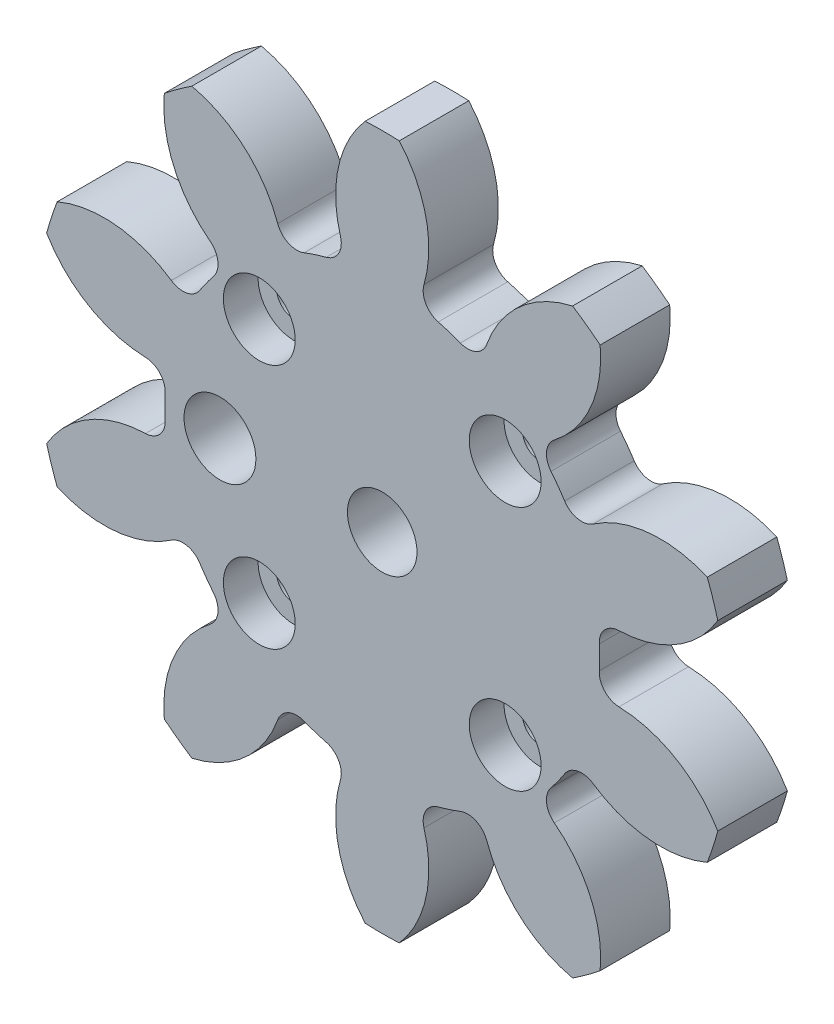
ISO-10303-21;
HEADER;
FILE_DESCRIPTION(('STEP AP214'),'2;1');
FILE_NAME('part.step','',(''),(''),'','','');
FILE_SCHEMA(('AUTOMOTIVE_DESIGN { 1 0 10303 214 1 1 1 1 }'));
ENDSEC;
DATA;
#1=APPLICATION_CONTEXT('core data for automotive mechanical design processes');
#2=APPLICATION_PROTOCOL_DEFINITION('international standard','automotive_design',2000,#1);
#3=PRODUCT_CONTEXT('',#1,'mechanical');
#4=PRODUCT('Part','Part','',(#3));
#5=PRODUCT_RELATED_PRODUCT_CATEGORY('part','',(#4));
#6=PRODUCT_DEFINITION_FORMATION('','',#4);
#7=PRODUCT_DEFINITION_CONTEXT('part definition',#1,'design');
#8=PRODUCT_DEFINITION('design','',#6,#7);
#9=PRODUCT_DEFINITION_SHAPE('','',#8);
#10=(LENGTH_UNIT() NAMED_UNIT(*) SI_UNIT(.MILLI.,.METRE.));
#11=(NAMED_UNIT(*) PLANE_ANGLE_UNIT() SI_UNIT($,.RADIAN.));
#12=(NAMED_UNIT(*) SI_UNIT($,.STERADIAN.) SOLID_ANGLE_UNIT());
#13=UNCERTAINTY_MEASURE_WITH_UNIT(LENGTH_MEASURE(1.E-05),#10,'distance_accuracy_value','');
#14=(GEOMETRIC_REPRESENTATION_CONTEXT(3) GLOBAL_UNCERTAINTY_ASSIGNED_CONTEXT((#13)) GLOBAL_UNIT_ASSIGNED_CONTEXT((#10,
#11,#12)) REPRESENTATION_CONTEXT('',''));
#15=CARTESIAN_POINT('',(0.,0.,0.));
#16=DIRECTION('',(0.,0.,1.));
#17=DIRECTION('',(1.,0.,0.));
#18=AXIS2_PLACEMENT_3D('',#15,#16,#17);
#19=CARTESIAN_POINT('',(10.6066017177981,10.6066017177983,0.));
#20=DIRECTION('',(0.,0.,1.));
#21=DIRECTION('',(1.,0.,0.));
#22=AXIS2_PLACEMENT_3D('',#19,#20,#21);
#23=CYLINDRICAL_SURFACE('',#22,1.5);
#24=CARTESIAN_POINT('',(10.6066017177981,10.6066017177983,0.));
#25=DIRECTION('',(0.,0.,1.));
#26=DIRECTION('',(-1.,0.,0.));
#27=AXIS2_PLACEMENT_3D('',#24,#25,#26);
#28=CIRCLE('',#27,1.5);
#29=CARTESIAN_POINT('',(9.10660171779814,10.6066017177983,0.));
#30=VERTEX_POINT('',#29);
#31=EDGE_CURVE('E901',#30,#30,#28,.T.);
#32=ORIENTED_EDGE('',*,*,#31,.F.);
#33=EDGE_LOOP('',(#32));
#34=FACE_BOUND('',#33,.T.);
#35=CARTESIAN_POINT('',(10.6066017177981,10.6066017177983,3.));
#36=DIRECTION('',(0.,0.,1.));
#37=DIRECTION('',(1.,0.,0.));
#38=AXIS2_PLACEMENT_3D('',#35,#36,#37);
#39=CIRCLE('',#38,1.5);
#40=CARTESIAN_POINT('',(12.1066017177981,10.6066017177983,3.));
#41=VERTEX_POINT('',#40);
#42=EDGE_CURVE('E30',#41,#41,#39,.F.);
#43=ORIENTED_EDGE('',*,*,#42,.F.);
#44=EDGE_LOOP('',(#43));
#45=FACE_BOUND('',#44,.T.);
#46=ADVANCED_FACE('F26',(#34,#45),#23,.F.);
#47=CARTESIAN_POINT('',(10.6066017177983,-10.6066017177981,0.));
#48=DIRECTION('',(0.,0.,1.));
#49=DIRECTION('',(1.,0.,0.));
#50=AXIS2_PLACEMENT_3D('',#47,#48,#49);
#51=CYLINDRICAL_SURFACE('',#50,1.5);
#52=CARTESIAN_POINT('',(10.6066017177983,-10.6066017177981,0.));
#53=DIRECTION('',(0.,0.,1.));
#54=DIRECTION('',(1.,0.,0.));
#55=AXIS2_PLACEMENT_3D('',#52,#53,#54);
#56=CIRCLE('',#55,1.5);
#57=CARTESIAN_POINT('',(12.1066017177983,-10.6066017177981,0.));
#58=VERTEX_POINT('',#57);
#59=EDGE_CURVE('E907',#58,#58,#56,.T.);
#60=ORIENTED_EDGE('',*,*,#59,.F.);
#61=EDGE_LOOP('',(#60));
#62=FACE_BOUND('',#61,.T.);
#63=CARTESIAN_POINT('',(10.6066017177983,-10.6066017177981,3.));
#64=DIRECTION('',(0.,0.,1.));
#65=DIRECTION('',(1.,0.,0.));
#66=AXIS2_PLACEMENT_3D('',#63,#64,#65);
#67=CIRCLE('',#66,1.5);
#68=CARTESIAN_POINT('',(12.1066017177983,-10.6066017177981,3.));
#69=VERTEX_POINT('',#68);
#70=EDGE_CURVE('E873',#69,#69,#67,.F.);
#71=ORIENTED_EDGE('',*,*,#70,.F.);
#72=EDGE_LOOP('',(#71));
#73=FACE_BOUND('',#72,.T.);
#74=ADVANCED_FACE('F980',(#62,#73),#51,.F.);
#75=CARTESIAN_POINT('',(-10.6066017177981,-10.6066017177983,0.));
#76=DIRECTION('',(0.,0.,1.));
#77=DIRECTION('',(1.,0.,0.));
#78=AXIS2_PLACEMENT_3D('',#75,#76,#77);
#79=CYLINDRICAL_SURFACE('',#78,1.5);
#80=CARTESIAN_POINT('',(-10.6066017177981,-10.6066017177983,0.));
#81=DIRECTION('',(0.,0.,1.));
#82=DIRECTION('',(1.,0.,0.));
#83=AXIS2_PLACEMENT_3D('',#80,#81,#82);
#84=CIRCLE('',#83,1.5);
#85=CARTESIAN_POINT('',(-9.10660171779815,-10.6066017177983,0.));
#86=VERTEX_POINT('',#85);
#87=EDGE_CURVE('E904',#86,#86,#84,.T.);
#88=ORIENTED_EDGE('',*,*,#87,.F.);
#89=EDGE_LOOP('',(#88));
#90=FACE_BOUND('',#89,.T.);
#91=CARTESIAN_POINT('',(-10.6066017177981,-10.6066017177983,3.));
#92=DIRECTION('',(0.,0.,1.));
#93=DIRECTION('',(1.,0.,0.));
#94=AXIS2_PLACEMENT_3D('',#91,#92,#93);
#95=CIRCLE('',#94,1.5);
#96=CARTESIAN_POINT('',(-9.10660171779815,-10.6066017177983,3.));
#97=VERTEX_POINT('',#96);
#98=EDGE_CURVE('E869',#97,#97,#95,.F.);
#99=ORIENTED_EDGE('',*,*,#98,.F.);
#100=EDGE_LOOP('',(#99));
#101=FACE_BOUND('',#100,.T.);
#102=ADVANCED_FACE('F987',(#90,#101),#79,.F.);
#103=CARTESIAN_POINT('',(-10.6066017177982,10.6066017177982,0.));
#104=DIRECTION('',(0.,0.,1.));
#105=DIRECTION('',(1.,0.,0.));
#106=AXIS2_PLACEMENT_3D('',#103,#104,#105);
#107=CYLINDRICAL_SURFACE('',#106,1.5);
#108=CARTESIAN_POINT('',(-10.6066017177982,10.6066017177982,0.));
#109=DIRECTION('',(0.,0.,1.));
#110=DIRECTION('',(1.,0.,0.));
#111=AXIS2_PLACEMENT_3D('',#108,#109,#110);
#112=CIRCLE('',#111,1.5);
#113=CARTESIAN_POINT('',(-9.10660171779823,10.6066017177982,0.));
#114=VERTEX_POINT('',#113);
#115=EDGE_CURVE('E909',#114,#114,#112,.T.);
#116=ORIENTED_EDGE('',*,*,#115,.F.);
#117=EDGE_LOOP('',(#116));
#118=FACE_BOUND('',#117,.T.);
#119=CARTESIAN_POINT('',(-10.6066017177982,10.6066017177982,3.));
#120=DIRECTION('',(0.,0.,1.));
#121=DIRECTION('',(1.,0.,0.));
#122=AXIS2_PLACEMENT_3D('',#119,#120,#121);
#123=CIRCLE('',#122,1.5);
#124=CARTESIAN_POINT('',(-9.10660171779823,10.6066017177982,3.));
#125=VERTEX_POINT('',#124);
#126=EDGE_CURVE('E864',#125,#125,#123,.F.);
#127=ORIENTED_EDGE('',*,*,#126,.F.);
#128=EDGE_LOOP('',(#127));
#129=FACE_BOUND('',#128,.T.);
#130=ADVANCED_FACE('F997',(#118,#129),#107,.F.);
#131=CARTESIAN_POINT('',(0.,0.,6.));
#132=DIRECTION('',(0.,0.,-1.));
#133=DIRECTION('',(-1.,0.,0.));
#134=AXIS2_PLACEMENT_3D('',#131,#132,#133);
#135=CYLINDRICAL_SURFACE('',#134,18.75);
#136=CARTESIAN_POINT('',(0.,0.,6.));
#137=DIRECTION('',(0.,0.,1.));
#138=DIRECTION('',(1.,0.,0.));
#139=AXIS2_PLACEMENT_3D('',#136,#137,#138);
#140=CIRCLE('',#139,18.75);
#141=CARTESIAN_POINT('',(6.74042417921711,17.4965477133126,6.));
#142=VERTEX_POINT('',#141);
#143=CARTESIAN_POINT('',(4.83109500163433,18.1169263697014,6.));
#144=VERTEX_POINT('',#143);
#145=EDGE_CURVE('E654',#142,#144,#140,.T.);
#146=ORIENTED_EDGE('',*,*,#145,.F.);
#147=DIRECTION('',(0.,0.,-1.));
#148=VECTOR('',#147,1.);
#149=CARTESIAN_POINT('',(6.74042417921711,17.4965477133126,6.));
#150=LINE('',#149,#148);
#151=CARTESIAN_POINT('',(6.74042417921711,17.4965477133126,0.));
#152=VERTEX_POINT('',#151);
#153=EDGE_CURVE('E698',#142,#152,#150,.T.);
#154=ORIENTED_EDGE('',*,*,#153,.T.);
#155=CARTESIAN_POINT('',(0.,0.,0.));
#156=DIRECTION('',(0.,0.,1.));
#157=DIRECTION('',(1.,0.,0.));
#158=AXIS2_PLACEMENT_3D('',#155,#156,#157);
#159=CIRCLE('',#158,18.75);
#160=CARTESIAN_POINT('',(4.83109500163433,18.1169263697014,0.));
#161=VERTEX_POINT('',#160);
#162=EDGE_CURVE('E642',#152,#161,#159,.T.);
#163=ORIENTED_EDGE('',*,*,#162,.T.);
#164=DIRECTION('',(0.,0.,-1.));
#165=VECTOR('',#164,1.);
#166=CARTESIAN_POINT('',(4.83109500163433,18.1169263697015,6.));
#167=LINE('',#166,#165);
#168=EDGE_CURVE('E674',#161,#144,#167,.F.);
#169=ORIENTED_EDGE('',*,*,#168,.T.);
#170=EDGE_LOOP('',(#146,#154,#163,#169));
#171=FACE_BOUND('',#170,.T.);
#172=ADVANCED_FACE('F28',(#171),#135,.T.);
#173=CARTESIAN_POINT('',(-6.22828729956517,23.1968293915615,6.));
#174=DIRECTION('',(0.,0.,-1.));
#175=DIRECTION('',(-1.,0.,0.));
#176=AXIS2_PLACEMENT_3D('',#173,#174,#175);
#177=CYLINDRICAL_SURFACE('',#176,10.2488291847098);
#178=CARTESIAN_POINT('',(-6.22828729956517,23.1968293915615,6.));
#179=DIRECTION('',(0.,0.,-1.));
#180=DIRECTION('',(-1.,0.,0.));
#181=AXIS2_PLACEMENT_3D('',#178,#179,#180);
#182=CIRCLE('',#181,10.2488291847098);
#183=CARTESIAN_POINT('',(1.46869465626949,29.9640273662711,6.));
#184=VERTEX_POINT('',#183);
#185=CARTESIAN_POINT('',(3.60325025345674,20.3021154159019,6.));
#186=VERTEX_POINT('',#185);
#187=EDGE_CURVE('E656',#184,#186,#182,.T.);
#188=ORIENTED_EDGE('',*,*,#187,.T.);
#189=DIRECTION('',(0.,0.,-1.));
#190=VECTOR('',#189,1.);
#191=CARTESIAN_POINT('',(3.60325025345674,20.3021154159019,6.));
#192=LINE('',#191,#190);
#193=CARTESIAN_POINT('',(3.60325025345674,20.3021154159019,0.));
#194=VERTEX_POINT('',#193);
#195=EDGE_CURVE('E671',#186,#194,#192,.T.);
#196=ORIENTED_EDGE('',*,*,#195,.T.);
#197=CARTESIAN_POINT('',(-6.22828729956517,23.1968293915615,0.));
#198=DIRECTION('',(0.,0.,-1.));
#199=DIRECTION('',(-1.,0.,0.));
#200=AXIS2_PLACEMENT_3D('',#197,#198,#199);
#201=CIRCLE('',#200,10.2488291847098);
#202=CARTESIAN_POINT('',(1.46869465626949,29.9640273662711,0.));
#203=VERTEX_POINT('',#202);
#204=EDGE_CURVE('E644',#203,#194,#201,.T.);
#205=ORIENTED_EDGE('',*,*,#204,.F.);
#206=DIRECTION('',(0.,0.,-1.));
#207=VECTOR('',#206,1.);
#208=CARTESIAN_POINT('',(1.46869465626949,29.9640273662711,6.));
#209=LINE('',#208,#207);
#210=EDGE_CURVE('E669',#184,#203,#209,.T.);
#211=ORIENTED_EDGE('',*,*,#210,.F.);
#212=EDGE_LOOP('',(#188,#196,#205,#211));
#213=FACE_BOUND('',#212,.T.);
#214=ADVANCED_FACE('F947',(#213),#177,.T.);
#215=CARTESIAN_POINT('',(0.,0.,6.));
#216=DIRECTION('',(0.,0.,-1.));
#217=DIRECTION('',(-1.,0.,0.));
#218=AXIS2_PLACEMENT_3D('',#215,#216,#217);
#219=CYLINDRICAL_SURFACE('',#218,30.);
#220=CARTESIAN_POINT('',(0.,0.,0.));
#221=DIRECTION('',(0.,0.,1.));
#222=DIRECTION('',(1.,0.,0.));
#223=AXIS2_PLACEMENT_3D('',#220,#221,#222);
#224=CIRCLE('',#223,30.);
#225=CARTESIAN_POINT('',(-1.46869465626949,29.9640273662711,0.));
#226=VERTEX_POINT('',#225);
#227=EDGE_CURVE('E647',#203,#226,#224,.T.);
#228=ORIENTED_EDGE('',*,*,#227,.T.);
#229=DIRECTION('',(0.,0.,-1.));
#230=VECTOR('',#229,1.);
#231=CARTESIAN_POINT('',(-1.46869465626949,29.9640273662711,6.));
#232=LINE('',#231,#230);
#233=CARTESIAN_POINT('',(-1.46869465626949,29.9640273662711,6.));
#234=VERTEX_POINT('',#233);
#235=EDGE_CURVE('E666',#234,#226,#232,.T.);
#236=ORIENTED_EDGE('',*,*,#235,.F.);
#237=CARTESIAN_POINT('',(0.,0.,6.));
#238=DIRECTION('',(0.,0.,1.));
#239=DIRECTION('',(1.,0.,0.));
#240=AXIS2_PLACEMENT_3D('',#237,#238,#239);
#241=CIRCLE('',#240,30.);
#242=EDGE_CURVE('E659',#184,#234,#241,.T.);
#243=ORIENTED_EDGE('',*,*,#242,.F.);
#244=ORIENTED_EDGE('',*,*,#210,.T.);
#245=EDGE_LOOP('',(#228,#236,#243,#244));
#246=FACE_BOUND('',#245,.T.);
#247=ADVANCED_FACE('F951',(#246),#219,.T.);
#248=CARTESIAN_POINT('',(6.22828729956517,23.1968293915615,6.));
#249=DIRECTION('',(0.,0.,-1.));
#250=DIRECTION('',(-1.,0.,0.));
#251=AXIS2_PLACEMENT_3D('',#248,#249,#250);
#252=CYLINDRICAL_SURFACE('',#251,10.2488291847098);
#253=CARTESIAN_POINT('',(6.22828729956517,23.1968293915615,0.));
#254=DIRECTION('',(0.,0.,1.));
#255=DIRECTION('',(1.,0.,0.));
#256=AXIS2_PLACEMENT_3D('',#253,#254,#255);
#257=CIRCLE('',#256,10.2488291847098);
#258=CARTESIAN_POINT('',(-3.60325025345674,20.3021154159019,0.));
#259=VERTEX_POINT('',#258);
#260=EDGE_CURVE('E649',#226,#259,#257,.T.);
#261=ORIENTED_EDGE('',*,*,#260,.T.);
#262=DIRECTION('',(0.,0.,-1.));
#263=VECTOR('',#262,1.);
#264=CARTESIAN_POINT('',(-3.60325025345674,20.3021154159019,6.));
#265=LINE('',#264,#263);
#266=CARTESIAN_POINT('',(-3.60325025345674,20.3021154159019,6.));
#267=VERTEX_POINT('',#266);
#268=EDGE_CURVE('E680',#259,#267,#265,.F.);
#269=ORIENTED_EDGE('',*,*,#268,.T.);
#270=CARTESIAN_POINT('',(6.22828729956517,23.1968293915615,6.));
#271=DIRECTION('',(0.,0.,1.));
#272=DIRECTION('',(1.,0.,0.));
#273=AXIS2_PLACEMENT_3D('',#270,#271,#272);
#274=CIRCLE('',#273,10.2488291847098);
#275=EDGE_CURVE('E661',#234,#267,#274,.T.);
#276=ORIENTED_EDGE('',*,*,#275,.F.);
#277=ORIENTED_EDGE('',*,*,#235,.T.);
#278=EDGE_LOOP('',(#261,#269,#276,#277));
#279=FACE_BOUND('',#278,.T.);
#280=ADVANCED_FACE('F968',(#279),#252,.T.);
#281=CARTESIAN_POINT('',(0.,0.,6.));
#282=DIRECTION('',(0.,0.,-1.));
#283=DIRECTION('',(-1.,0.,0.));
#284=AXIS2_PLACEMENT_3D('',#281,#282,#283);
#285=CYLINDRICAL_SURFACE('',#284,18.75);
#286=CARTESIAN_POINT('',(0.,0.,0.));
#287=DIRECTION('',(0.,0.,-1.));
#288=DIRECTION('',(-1.,0.,0.));
#289=AXIS2_PLACEMENT_3D('',#286,#287,#288);
#290=CIRCLE('',#289,18.75);
#291=CARTESIAN_POINT('',(-6.74042417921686,17.4965477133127,0.));
#292=VERTEX_POINT('',#291);
#293=CARTESIAN_POINT('',(-4.83109500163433,18.1169263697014,0.));
#294=VERTEX_POINT('',#293);
#295=EDGE_CURVE('E652',#292,#294,#290,.T.);
#296=ORIENTED_EDGE('',*,*,#295,.F.);
#297=DIRECTION('',(0.,0.,-1.));
#298=VECTOR('',#297,1.);
#299=CARTESIAN_POINT('',(-6.74042417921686,17.4965477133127,6.));
#300=LINE('',#299,#298);
#301=CARTESIAN_POINT('',(-6.74042417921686,17.4965477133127,6.));
#302=VERTEX_POINT('',#301);
#303=EDGE_CURVE('E853',#292,#302,#300,.F.);
#304=ORIENTED_EDGE('',*,*,#303,.T.);
#305=CARTESIAN_POINT('',(0.,0.,6.));
#306=DIRECTION('',(0.,0.,-1.));
#307=DIRECTION('',(-1.,0.,0.));
#308=AXIS2_PLACEMENT_3D('',#305,#306,#307);
#309=CIRCLE('',#308,18.75);
#310=CARTESIAN_POINT('',(-4.83109500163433,18.1169263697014,6.));
#311=VERTEX_POINT('',#310);
#312=EDGE_CURVE('E664',#302,#311,#309,.T.);
#313=ORIENTED_EDGE('',*,*,#312,.T.);
#314=DIRECTION('',(0.,0.,-1.));
#315=VECTOR('',#314,1.);
#316=CARTESIAN_POINT('',(-4.83109500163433,18.1169263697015,6.));
#317=LINE('',#316,#315);
#318=EDGE_CURVE('E677',#311,#294,#317,.T.);
#319=ORIENTED_EDGE('',*,*,#318,.T.);
#320=EDGE_LOOP('',(#296,#304,#313,#319));
#321=FACE_BOUND('',#320,.T.);
#322=ADVANCED_FACE('F922',(#321),#285,.T.);
#323=CARTESIAN_POINT('',(0.,0.,6.));
#324=DIRECTION('',(0.,0.,1.));
#325=DIRECTION('',(1.,0.,0.));
#326=AXIS2_PLACEMENT_3D('',#323,#324,#325);
#327=PLANE('',#326);
#328=CARTESIAN_POINT('',(10.6066017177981,10.6066017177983,6.));
#329=DIRECTION('',(0.,0.,1.));
#330=DIRECTION('',(1.,0.,0.));
#331=AXIS2_PLACEMENT_3D('',#328,#329,#330);
#332=CIRCLE('',#331,3.1);
#333=CARTESIAN_POINT('',(13.7066017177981,10.6066017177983,6.));
#334=VERTEX_POINT('',#333);
#335=EDGE_CURVE('E1327',#334,#334,#332,.T.);
#336=ORIENTED_EDGE('',*,*,#335,.F.);
#337=EDGE_LOOP('',(#336));
#338=FACE_BOUND('',#337,.T.);
#339=CARTESIAN_POINT('',(10.6066017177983,-10.6066017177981,6.));
#340=DIRECTION('',(0.,0.,1.));
#341=DIRECTION('',(1.,0.,0.));
#342=AXIS2_PLACEMENT_3D('',#339,#340,#341);
#343=CIRCLE('',#342,3.1);
#344=CARTESIAN_POINT('',(13.7066017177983,-10.6066017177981,6.));
#345=VERTEX_POINT('',#344);
#346=EDGE_CURVE('E882',#345,#345,#343,.T.);
#347=ORIENTED_EDGE('',*,*,#346,.F.);
#348=EDGE_LOOP('',(#347));
#349=FACE_BOUND('',#348,.T.);
#350=CARTESIAN_POINT('',(-10.6066017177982,-10.6066017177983,6.));
#351=DIRECTION('',(0.,0.,1.));
#352=DIRECTION('',(1.,0.,0.));
#353=AXIS2_PLACEMENT_3D('',#350,#351,#352);
#354=CIRCLE('',#353,3.1);
#355=CARTESIAN_POINT('',(-7.50660171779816,-10.6066017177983,6.));
#356=VERTEX_POINT('',#355);
#357=EDGE_CURVE('E875',#356,#356,#354,.T.);
#358=ORIENTED_EDGE('',*,*,#357,.F.);
#359=EDGE_LOOP('',(#358));
#360=FACE_BOUND('',#359,.T.);
#361=CARTESIAN_POINT('',(-10.6066017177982,10.6066017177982,6.));
#362=DIRECTION('',(0.,0.,1.));
#363=DIRECTION('',(1.,0.,0.));
#364=AXIS2_PLACEMENT_3D('',#361,#362,#363);
#365=CIRCLE('',#364,3.1);
#366=CARTESIAN_POINT('',(-7.50660171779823,10.6066017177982,6.));
#367=VERTEX_POINT('',#366);
#368=EDGE_CURVE('E871',#367,#367,#365,.T.);
#369=ORIENTED_EDGE('',*,*,#368,.F.);
#370=EDGE_LOOP('',(#369));
#371=FACE_BOUND('',#370,.T.);
#372=CARTESIAN_POINT('',(-14.,0.,6.));
#373=DIRECTION('',(0.,0.,1.));
#374=DIRECTION('',(1.,0.,0.));
#375=AXIS2_PLACEMENT_3D('',#372,#373,#374);
#376=CIRCLE('',#375,3.1);
#377=CARTESIAN_POINT('',(-10.9,0.,6.));
#378=VERTEX_POINT('',#377);
#379=EDGE_CURVE('E867',#378,#378,#376,.T.);
#380=ORIENTED_EDGE('',*,*,#379,.F.);
#381=EDGE_LOOP('',(#380));
#382=FACE_BOUND('',#381,.T.);
#383=CARTESIAN_POINT('',(0.,0.,6.));
#384=DIRECTION('',(0.,0.,1.));
#385=DIRECTION('',(1.,0.,0.));
#386=AXIS2_PLACEMENT_3D('',#383,#384,#385);
#387=CIRCLE('',#386,3.);
#388=CARTESIAN_POINT('',(3.,0.,6.));
#389=VERTEX_POINT('',#388);
#390=EDGE_CURVE('E431',#389,#389,#387,.T.);
#391=ORIENTED_EDGE('',*,*,#390,.F.);
#392=EDGE_LOOP('',(#391));
#393=FACE_BOUND('',#392,.T.);
#394=CARTESIAN_POINT('',(18.6735444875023,15.1057337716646,6.));
#395=DIRECTION('',(0.,0.,1.));
#396=DIRECTION('',(0.809016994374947,-0.587785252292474,0.));
#397=AXIS2_PLACEMENT_3D('',#394,#395,#396);
#398=CIRCLE('',#397,10.2488291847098);
#399=CARTESIAN_POINT('',(16.4242144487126,25.1046844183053,6.));
#400=VERTEX_POINT('',#399);
#401=CARTESIAN_POINT('',(9.01819334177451,18.5426937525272,6.));
#402=VERTEX_POINT('',#401);
#403=EDGE_CURVE('E634',#400,#402,#398,.T.);
#404=ORIENTED_EDGE('',*,*,#403,.T.);
#405=CARTESIAN_POINT('',(7.36953043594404,19.1295588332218,6.));
#406=DIRECTION('',(0.,0.,1.));
#407=DIRECTION('',(1.,0.,0.));
#408=AXIS2_PLACEMENT_3D('',#405,#406,#407);
#409=CIRCLE('',#408,1.75);
#410=EDGE_CURVE('E710',#402,#142,#409,.F.);
#411=ORIENTED_EDGE('',*,*,#410,.T.);
#412=ORIENTED_EDGE('',*,*,#145,.T.);
#413=CARTESIAN_POINT('',(5.28199720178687,19.8078394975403,6.));
#414=DIRECTION('',(0.,0.,1.));
#415=DIRECTION('',(1.,0.,0.));
#416=AXIS2_PLACEMENT_3D('',#413,#414,#415);
#417=CIRCLE('',#416,1.75);
#418=EDGE_CURVE('E685',#144,#186,#417,.F.);
#419=ORIENTED_EDGE('',*,*,#418,.T.);
#420=ORIENTED_EDGE('',*,*,#187,.F.);
#421=ORIENTED_EDGE('',*,*,#242,.T.);
#422=ORIENTED_EDGE('',*,*,#275,.T.);
#423=CARTESIAN_POINT('',(-5.28199720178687,19.8078394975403,6.));
#424=DIRECTION('',(0.,0.,1.));
#425=DIRECTION('',(1.,0.,0.));
#426=AXIS2_PLACEMENT_3D('',#423,#424,#425);
#427=CIRCLE('',#426,1.75);
#428=EDGE_CURVE('E689',#267,#311,#427,.F.);
#429=ORIENTED_EDGE('',*,*,#428,.T.);
#430=ORIENTED_EDGE('',*,*,#312,.F.);
#431=CARTESIAN_POINT('',(-7.36953043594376,19.1295588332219,6.));
#432=DIRECTION('',(0.,0.,1.));
#433=DIRECTION('',(1.,0.,0.));
#434=AXIS2_PLACEMENT_3D('',#431,#432,#433);
#435=CIRCLE('',#434,1.75);
#436=CARTESIAN_POINT('',(-9.01819334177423,18.5426937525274,6.));
#437=VERTEX_POINT('',#436);
#438=EDGE_CURVE('E861',#302,#437,#435,.F.);
#439=ORIENTED_EDGE('',*,*,#438,.T.);
#440=CARTESIAN_POINT('',(-18.6735444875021,15.1057337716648,6.));
#441=DIRECTION('',(0.,0.,-1.));
#442=DIRECTION('',(-0.809016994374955,-0.587785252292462,0.));
#443=AXIS2_PLACEMENT_3D('',#440,#441,#442);
#444=CIRCLE('',#443,10.2488291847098);
#445=CARTESIAN_POINT('',(-16.4242144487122,25.1046844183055,6.));
#446=VERTEX_POINT('',#445);
#447=EDGE_CURVE('E437',#446,#437,#444,.T.);
#448=ORIENTED_EDGE('',*,*,#447,.F.);
#449=CARTESIAN_POINT('',(0.,0.,6.));
#450=DIRECTION('',(0.,0.,1.));
#451=DIRECTION('',(0.809016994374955,0.587785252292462,0.));
#452=AXIS2_PLACEMENT_3D('',#449,#450,#451);
#453=CIRCLE('',#452,30.);
#454=CARTESIAN_POINT('',(-18.8006123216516,23.3781303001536,6.));
#455=VERTEX_POINT('',#454);
#456=EDGE_CURVE('E410',#446,#455,#453,.T.);
#457=ORIENTED_EDGE('',*,*,#456,.T.);
#458=CARTESIAN_POINT('',(-8.59596394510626,22.4275246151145,6.));
#459=DIRECTION('',(0.,0.,1.));
#460=DIRECTION('',(0.809016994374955,0.587785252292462,0.));
#461=AXIS2_PLACEMENT_3D('',#458,#459,#460);
#462=CIRCLE('',#461,10.2488291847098);
#463=CARTESIAN_POINT('',(-14.848374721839,14.3068190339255,6.));
#464=VERTEX_POINT('',#463);
#465=EDGE_CURVE('E440',#455,#464,#462,.T.);
#466=ORIENTED_EDGE('',*,*,#465,.T.);
#467=CARTESIAN_POINT('',(-15.9159814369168,12.9201987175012,6.));
#468=DIRECTION('',(0.,0.,1.));
#469=DIRECTION('',(1.,0.,0.));
#470=AXIS2_PLACEMENT_3D('',#467,#468,#469);
#471=CIRCLE('',#470,1.75);
#472=CARTESIAN_POINT('',(-14.557300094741,11.8172549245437,6.));
#473=VERTEX_POINT('',#472);
#474=EDGE_CURVE('E11',#464,#473,#471,.F.);
#475=ORIENTED_EDGE('',*,*,#474,.T.);
#476=CARTESIAN_POINT('',(0.,0.,6.));
#477=DIRECTION('',(0.,0.,1.));
#478=DIRECTION('',(0.309016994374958,0.95105651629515,0.));
#479=AXIS2_PLACEMENT_3D('',#476,#477,#478);
#480=CIRCLE('',#479,18.75);
#481=CARTESIAN_POINT('',(-15.7373304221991,10.1930825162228,6.));
#482=VERTEX_POINT('',#481);
#483=EDGE_CURVE('E452',#473,#482,#480,.T.);
#484=ORIENTED_EDGE('',*,*,#483,.T.);
#485=CARTESIAN_POINT('',(-17.206147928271,11.1444368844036,6.));
#486=DIRECTION('',(0.,0.,1.));
#487=DIRECTION('',(1.,0.,0.));
#488=AXIS2_PLACEMENT_3D('',#485,#486,#487);
#489=CIRCLE('',#488,1.75);
#490=CARTESIAN_POINT('',(-18.1949935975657,9.70059331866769,6.));
#491=VERTEX_POINT('',#490);
#492=EDGE_CURVE('E846',#482,#491,#489,.F.);
#493=ORIENTED_EDGE('',*,*,#492,.T.);
#494=CARTESIAN_POINT('',(-23.9861423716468,1.24476127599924,6.));
#495=DIRECTION('',(0.,0.,-1.));
#496=DIRECTION('',(-0.309016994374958,-0.95105651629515,0.));
#497=AXIS2_PLACEMENT_3D('',#494,#495,#496);
#498=CIRCLE('',#497,10.2488291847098);
#499=CARTESIAN_POINT('',(-28.0436318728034,10.6562052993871,6.));
#500=VERTEX_POINT('',#499);
#501=EDGE_CURVE('E454',#500,#491,#498,.T.);
#502=ORIENTED_EDGE('',*,*,#501,.F.);
#503=CARTESIAN_POINT('',(0.,0.,6.));
#504=DIRECTION('',(0.,0.,1.));
#505=DIRECTION('',(0.309016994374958,0.95105651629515,0.));
#506=AXIS2_PLACEMENT_3D('',#503,#504,#505);
#507=CIRCLE('',#506,30.);
#508=CARTESIAN_POINT('',(-28.9513350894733,7.86258205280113,6.));
#509=VERTEX_POINT('',#508);
#510=EDGE_CURVE('E457',#500,#509,#507,.T.);
#511=ORIENTED_EDGE('',*,*,#510,.T.);
#512=CARTESIAN_POINT('',(-20.1368491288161,13.0916677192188,6.));
#513=DIRECTION('',(0.,0.,1.));
#514=DIRECTION('',(0.309016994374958,0.95105651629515,0.));
#515=AXIS2_PLACEMENT_3D('',#512,#513,#514);
#516=CIRCLE('',#515,10.2488291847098);
#517=CARTESIAN_POINT('',(-20.4219247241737,2.84680405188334,6.));
#518=VERTEX_POINT('',#517);
#519=EDGE_CURVE('E459',#509,#518,#516,.T.);
#520=ORIENTED_EDGE('',*,*,#519,.T.);
#521=CARTESIAN_POINT('',(-20.4706017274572,1.09748116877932,6.));
#522=DIRECTION('',(0.,0.,1.));
#523=DIRECTION('',(1.,0.,0.));
#524=AXIS2_PLACEMENT_3D('',#521,#522,#523);
#525=CIRCLE('',#524,1.75);
#526=CARTESIAN_POINT('',(-18.7231113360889,1.00379375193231,6.));
#527=VERTEX_POINT('',#526);
#528=EDGE_CURVE('E850',#518,#527,#525,.F.);
#529=ORIENTED_EDGE('',*,*,#528,.T.);
#530=CARTESIAN_POINT('',(0.,0.,6.));
#531=DIRECTION('',(0.,0.,1.));
#532=DIRECTION('',(-0.309016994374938,0.951056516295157,0.));
#533=AXIS2_PLACEMENT_3D('',#530,#531,#532);
#534=CIRCLE('',#533,18.75);
#535=CARTESIAN_POINT('',(-18.7231113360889,-1.00379375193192,6.));
#536=VERTEX_POINT('',#535);
#537=EDGE_CURVE('E477',#527,#536,#534,.T.);
#538=ORIENTED_EDGE('',*,*,#537,.T.);
#539=CARTESIAN_POINT('',(-20.4706017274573,-1.09748116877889,6.));
#540=DIRECTION('',(0.,0.,1.));
#541=DIRECTION('',(1.,0.,0.));
#542=AXIS2_PLACEMENT_3D('',#539,#540,#541);
#543=CIRCLE('',#542,1.75);
#544=CARTESIAN_POINT('',(-20.4219247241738,-2.84680405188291,6.));
#545=VERTEX_POINT('',#544);
#546=EDGE_CURVE('E826',#536,#545,#543,.F.);
#547=ORIENTED_EDGE('',*,*,#546,.T.);
#548=CARTESIAN_POINT('',(-20.1368491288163,-13.0916677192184,6.));
#549=DIRECTION('',(0.,0.,-1.));
#550=DIRECTION('',(0.309016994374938,-0.951056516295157,0.));
#551=AXIS2_PLACEMENT_3D('',#548,#549,#550);
#552=CIRCLE('',#551,10.2488291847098);
#553=CARTESIAN_POINT('',(-28.9513350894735,-7.86258205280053,6.));
#554=VERTEX_POINT('',#553);
#555=EDGE_CURVE('E479',#554,#545,#552,.T.);
#556=ORIENTED_EDGE('',*,*,#555,.F.);
#557=CARTESIAN_POINT('',(0.,0.,6.));
#558=DIRECTION('',(0.,0.,1.));
#559=DIRECTION('',(-0.309016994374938,0.951056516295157,0.));
#560=AXIS2_PLACEMENT_3D('',#557,#558,#559);
#561=CIRCLE('',#560,30.);
#562=CARTESIAN_POINT('',(-28.0436318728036,-10.6562052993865,6.));
#563=VERTEX_POINT('',#562);
#564=EDGE_CURVE('E482',#554,#563,#561,.T.);
#565=ORIENTED_EDGE('',*,*,#564,.T.);
#566=CARTESIAN_POINT('',(-23.9861423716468,-1.24476127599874,6.));
#567=DIRECTION('',(0.,0.,1.));
#568=DIRECTION('',(-0.309016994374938,0.951056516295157,0.));
#569=AXIS2_PLACEMENT_3D('',#566,#567,#568);
#570=CIRCLE('',#569,10.2488291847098);
#571=CARTESIAN_POINT('',(-18.1949935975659,-9.70059331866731,6.));
#572=VERTEX_POINT('',#571);
#573=EDGE_CURVE('E484',#563,#572,#570,.T.);
#574=ORIENTED_EDGE('',*,*,#573,.T.);
#575=CARTESIAN_POINT('',(-17.2061479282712,-11.1444368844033,6.));
#576=DIRECTION('',(0.,0.,1.));
#577=DIRECTION('',(1.,0.,0.));
#578=AXIS2_PLACEMENT_3D('',#575,#576,#577);
#579=CIRCLE('',#578,1.75);
#580=CARTESIAN_POINT('',(-15.7373304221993,-10.1930825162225,6.));
#581=VERTEX_POINT('',#580);
#582=EDGE_CURVE('E830',#572,#581,#579,.F.);
#583=ORIENTED_EDGE('',*,*,#582,.T.);
#584=CARTESIAN_POINT('',(0.,0.,6.));
#585=DIRECTION('',(0.,0.,1.));
#586=DIRECTION('',(-0.809016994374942,0.58778525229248,0.));
#587=AXIS2_PLACEMENT_3D('',#584,#585,#586);
#588=CIRCLE('',#587,18.75);
#589=CARTESIAN_POINT('',(-14.5573000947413,-11.8172549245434,6.));
#590=VERTEX_POINT('',#589);
#591=EDGE_CURVE('E502',#581,#590,#588,.T.);
#592=ORIENTED_EDGE('',*,*,#591,.T.);
#593=CARTESIAN_POINT('',(-15.9159814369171,-12.9201987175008,6.));
#594=DIRECTION('',(0.,0.,1.));
#595=DIRECTION('',(1.,0.,0.));
#596=AXIS2_PLACEMENT_3D('',#593,#594,#595);
#597=CIRCLE('',#596,1.75);
#598=CARTESIAN_POINT('',(-14.8483747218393,-14.3068190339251,6.));
#599=VERTEX_POINT('',#598);
#600=EDGE_CURVE('E806',#590,#599,#597,.F.);
#601=ORIENTED_EDGE('',*,*,#600,.T.);
#602=CARTESIAN_POINT('',(-8.59596394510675,-22.4275246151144,6.));
#603=DIRECTION('',(0.,0.,-1.));
#604=DIRECTION('',(0.809016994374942,-0.58778525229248,0.));
#605=AXIS2_PLACEMENT_3D('',#602,#603,#604);
#606=CIRCLE('',#605,10.2488291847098);
#607=CARTESIAN_POINT('',(-18.8006123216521,-23.3781303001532,6.));
#608=VERTEX_POINT('',#607);
#609=EDGE_CURVE('E504',#608,#599,#606,.T.);
#610=ORIENTED_EDGE('',*,*,#609,.F.);
#611=CARTESIAN_POINT('',(0.,0.,6.));
#612=DIRECTION('',(0.,0.,1.));
#613=DIRECTION('',(-0.809016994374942,0.58778525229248,0.));
#614=AXIS2_PLACEMENT_3D('',#611,#612,#613);
#615=CIRCLE('',#614,30.);
#616=CARTESIAN_POINT('',(-16.4242144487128,-25.1046844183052,6.));
#617=VERTEX_POINT('',#616);
#618=EDGE_CURVE('E507',#608,#617,#615,.T.);
#619=ORIENTED_EDGE('',*,*,#618,.T.);
#620=CARTESIAN_POINT('',(-18.6735444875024,-15.1057337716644,6.));
#621=DIRECTION('',(0.,0.,1.));
#622=DIRECTION('',(-0.809016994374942,0.58778525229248,0.));
#623=AXIS2_PLACEMENT_3D('',#620,#621,#622);
#624=CIRCLE('',#623,10.2488291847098);
#625=CARTESIAN_POINT('',(-9.01819334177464,-18.5426937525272,6.));
#626=VERTEX_POINT('',#625);
#627=EDGE_CURVE('E509',#617,#626,#624,.T.);
#628=ORIENTED_EDGE('',*,*,#627,.T.);
#629=CARTESIAN_POINT('',(-7.36953043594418,-19.1295588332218,6.));
#630=DIRECTION('',(0.,0.,1.));
#631=DIRECTION('',(1.,0.,0.));
#632=AXIS2_PLACEMENT_3D('',#629,#630,#631);
#633=CIRCLE('',#632,1.75);
#634=CARTESIAN_POINT('',(-6.74042417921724,-17.4965477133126,6.));
#635=VERTEX_POINT('',#634);
#636=EDGE_CURVE('E810',#626,#635,#633,.F.);
#637=ORIENTED_EDGE('',*,*,#636,.T.);
#638=CARTESIAN_POINT('',(0.,0.,6.));
#639=DIRECTION('',(0.,0.,1.));
#640=DIRECTION('',(-1.,0.,0.));
#641=AXIS2_PLACEMENT_3D('',#638,#639,#640);
#642=CIRCLE('',#641,18.75);
#643=CARTESIAN_POINT('',(-4.83109500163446,-18.1169263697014,6.));
#644=VERTEX_POINT('',#643);
#645=EDGE_CURVE('E527',#635,#644,#642,.T.);
#646=ORIENTED_EDGE('',*,*,#645,.T.);
#647=CARTESIAN_POINT('',(-5.28199720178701,-19.8078394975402,6.));
#648=DIRECTION('',(0.,0.,1.));
#649=DIRECTION('',(1.,0.,0.));
#650=AXIS2_PLACEMENT_3D('',#647,#648,#649);
#651=CIRCLE('',#650,1.75);
#652=CARTESIAN_POINT('',(-3.60325025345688,-20.3021154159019,6.));
#653=VERTEX_POINT('',#652);
#654=EDGE_CURVE('E786',#644,#653,#651,.F.);
#655=ORIENTED_EDGE('',*,*,#654,.T.);
#656=CARTESIAN_POINT('',(6.22828729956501,-23.1968293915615,6.));
#657=DIRECTION('',(0.,0.,-1.));
#658=DIRECTION('',(1.,0.,0.));
#659=AXIS2_PLACEMENT_3D('',#656,#657,#658);
#660=CIRCLE('',#659,10.2488291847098);
#661=CARTESIAN_POINT('',(-1.4686946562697,-29.9640273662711,6.));
#662=VERTEX_POINT('',#661);
#663=EDGE_CURVE('E529',#662,#653,#660,.T.);
#664=ORIENTED_EDGE('',*,*,#663,.F.);
#665=CARTESIAN_POINT('',(0.,0.,6.));
#666=DIRECTION('',(0.,0.,1.));
#667=DIRECTION('',(-1.,0.,0.));
#668=AXIS2_PLACEMENT_3D('',#665,#666,#667);
#669=CIRCLE('',#668,30.);
#670=CARTESIAN_POINT('',(1.46869465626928,-29.9640273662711,6.));
#671=VERTEX_POINT('',#670);
#672=EDGE_CURVE('E532',#662,#671,#669,.T.);
#673=ORIENTED_EDGE('',*,*,#672,.T.);
#674=CARTESIAN_POINT('',(-6.22828729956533,-23.1968293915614,6.));
#675=DIRECTION('',(0.,0.,1.));
#676=DIRECTION('',(-1.,0.,0.));
#677=AXIS2_PLACEMENT_3D('',#674,#675,#676);
#678=CIRCLE('',#677,10.2488291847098);
#679=CARTESIAN_POINT('',(3.60325025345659,-20.3021154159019,6.));
#680=VERTEX_POINT('',#679);
#681=EDGE_CURVE('E534',#671,#680,#678,.T.);
#682=ORIENTED_EDGE('',*,*,#681,.T.);
#683=CARTESIAN_POINT('',(5.28199720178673,-19.8078394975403,6.));
#684=DIRECTION('',(0.,0.,1.));
#685=DIRECTION('',(1.,0.,0.));
#686=AXIS2_PLACEMENT_3D('',#683,#684,#685);
#687=CIRCLE('',#686,1.75);
#688=CARTESIAN_POINT('',(4.8310950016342,-18.1169263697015,6.));
#689=VERTEX_POINT('',#688);
#690=EDGE_CURVE('E790',#680,#689,#687,.F.);
#691=ORIENTED_EDGE('',*,*,#690,.T.);
#692=CARTESIAN_POINT('',(0.,0.,6.));
#693=DIRECTION('',(0.,0.,1.));
#694=DIRECTION('',(-0.809016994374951,-0.587785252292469,0.));
#695=AXIS2_PLACEMENT_3D('',#692,#693,#694);
#696=CIRCLE('',#695,18.75);
#697=CARTESIAN_POINT('',(6.74042417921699,-17.4965477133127,6.));
#698=VERTEX_POINT('',#697);
#699=EDGE_CURVE('E552',#689,#698,#696,.T.);
#700=ORIENTED_EDGE('',*,*,#699,.T.);
#701=CARTESIAN_POINT('',(7.36953043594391,-19.1295588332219,6.));
#702=DIRECTION('',(0.,0.,1.));
#703=DIRECTION('',(1.,0.,0.));
#704=AXIS2_PLACEMENT_3D('',#701,#702,#703);
#705=CIRCLE('',#704,1.75);
#706=CARTESIAN_POINT('',(9.01819334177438,-18.5426937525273,6.));
#707=VERTEX_POINT('',#706);
#708=EDGE_CURVE('E766',#698,#707,#705,.F.);
#709=ORIENTED_EDGE('',*,*,#708,.T.);
#710=CARTESIAN_POINT('',(18.6735444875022,-15.1057337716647,6.));
#711=DIRECTION('',(0.,0.,-1.));
#712=DIRECTION('',(0.809016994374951,0.587785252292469,0.));
#713=AXIS2_PLACEMENT_3D('',#710,#711,#712);
#714=CIRCLE('',#713,10.2488291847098);
#715=CARTESIAN_POINT('',(16.4242144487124,-25.1046844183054,6.));
#716=VERTEX_POINT('',#715);
#717=EDGE_CURVE('E554',#716,#707,#714,.T.);
#718=ORIENTED_EDGE('',*,*,#717,.F.);
#719=CARTESIAN_POINT('',(0.,0.,6.));
#720=DIRECTION('',(0.,0.,1.));
#721=DIRECTION('',(-0.809016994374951,-0.587785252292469,0.));
#722=AXIS2_PLACEMENT_3D('',#719,#720,#721);
#723=CIRCLE('',#722,30.);
#724=CARTESIAN_POINT('',(18.8006123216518,-23.3781303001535,6.));
#725=VERTEX_POINT('',#724);
#726=EDGE_CURVE('E557',#716,#725,#723,.T.);
#727=ORIENTED_EDGE('',*,*,#726,.T.);
#728=CARTESIAN_POINT('',(8.59596394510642,-22.4275246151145,6.));
#729=DIRECTION('',(0.,0.,1.));
#730=DIRECTION('',(-0.809016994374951,-0.587785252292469,0.));
#731=AXIS2_PLACEMENT_3D('',#728,#729,#730);
#732=CIRCLE('',#731,10.2488291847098);
#733=CARTESIAN_POINT('',(14.8483747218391,-14.3068190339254,6.));
#734=VERTEX_POINT('',#733);
#735=EDGE_CURVE('E559',#725,#734,#732,.T.);
#736=ORIENTED_EDGE('',*,*,#735,.T.);
#737=CARTESIAN_POINT('',(15.9159814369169,-12.920198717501,6.));
#738=DIRECTION('',(0.,0.,1.));
#739=DIRECTION('',(1.,0.,0.));
#740=AXIS2_PLACEMENT_3D('',#737,#738,#739);
#741=CIRCLE('',#740,1.75);
#742=CARTESIAN_POINT('',(14.5573000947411,-11.8172549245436,6.));
#743=VERTEX_POINT('',#742);
#744=EDGE_CURVE('E770',#734,#743,#741,.F.);
#745=ORIENTED_EDGE('',*,*,#744,.T.);
#746=CARTESIAN_POINT('',(0.,0.,6.));
#747=DIRECTION('',(0.,0.,1.));
#748=DIRECTION('',(-0.309016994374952,-0.951056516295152,0.));
#749=AXIS2_PLACEMENT_3D('',#746,#747,#748);
#750=CIRCLE('',#749,18.75);
#751=CARTESIAN_POINT('',(15.7373304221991,-10.1930825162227,6.));
#752=VERTEX_POINT('',#751);
#753=EDGE_CURVE('E577',#743,#752,#750,.T.);
#754=ORIENTED_EDGE('',*,*,#753,.T.);
#755=CARTESIAN_POINT('',(17.2061479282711,-11.1444368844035,6.));
#756=DIRECTION('',(0.,0.,1.));
#757=DIRECTION('',(1.,0.,0.));
#758=AXIS2_PLACEMENT_3D('',#755,#756,#757);
#759=CIRCLE('',#758,1.75);
#760=CARTESIAN_POINT('',(18.1949935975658,-9.70059331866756,6.));
#761=VERTEX_POINT('',#760);
#762=EDGE_CURVE('E746',#752,#761,#759,.F.);
#763=ORIENTED_EDGE('',*,*,#762,.T.);
#764=CARTESIAN_POINT('',(23.9861423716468,-1.24476127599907,6.));
#765=DIRECTION('',(0.,0.,-1.));
#766=DIRECTION('',(0.309016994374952,0.951056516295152,0.));
#767=AXIS2_PLACEMENT_3D('',#764,#765,#766);
#768=CIRCLE('',#767,10.2488291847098);
#769=CARTESIAN_POINT('',(28.0436318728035,-10.6562052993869,6.));
#770=VERTEX_POINT('',#769);
#771=EDGE_CURVE('E579',#770,#761,#768,.T.);
#772=ORIENTED_EDGE('',*,*,#771,.F.);
#773=CARTESIAN_POINT('',(0.,0.,6.));
#774=DIRECTION('',(0.,0.,1.));
#775=DIRECTION('',(-0.309016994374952,-0.951056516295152,0.));
#776=AXIS2_PLACEMENT_3D('',#773,#774,#775);
#777=CIRCLE('',#776,30.);
#778=CARTESIAN_POINT('',(28.9513350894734,-7.86258205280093,6.));
#779=VERTEX_POINT('',#778);
#780=EDGE_CURVE('E582',#770,#779,#777,.T.);
#781=ORIENTED_EDGE('',*,*,#780,.T.);
#782=CARTESIAN_POINT('',(20.1368491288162,-13.0916677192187,6.));
#783=DIRECTION('',(0.,0.,1.));
#784=DIRECTION('',(-0.309016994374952,-0.951056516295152,0.));
#785=AXIS2_PLACEMENT_3D('',#782,#783,#784);
#786=CIRCLE('',#785,10.2488291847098);
#787=CARTESIAN_POINT('',(20.4219247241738,-2.8468040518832,6.));
#788=VERTEX_POINT('',#787);
#789=EDGE_CURVE('E584',#779,#788,#786,.T.);
#790=ORIENTED_EDGE('',*,*,#789,.T.);
#791=CARTESIAN_POINT('',(20.4706017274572,-1.09748116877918,6.));
#792=DIRECTION('',(0.,0.,1.));
#793=DIRECTION('',(1.,0.,0.));
#794=AXIS2_PLACEMENT_3D('',#791,#792,#793);
#795=CIRCLE('',#794,1.75);
#796=CARTESIAN_POINT('',(18.7231113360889,-1.00379375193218,6.));
#797=VERTEX_POINT('',#796);
#798=EDGE_CURVE('E750',#788,#797,#795,.F.);
#799=ORIENTED_EDGE('',*,*,#798,.T.);
#800=CARTESIAN_POINT('',(0.,0.,6.));
#801=DIRECTION('',(0.,0.,1.));
#802=DIRECTION('',(0.309016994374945,-0.951056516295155,0.));
#803=AXIS2_PLACEMENT_3D('',#800,#801,#802);
#804=CIRCLE('',#803,18.75);
#805=CARTESIAN_POINT('',(18.7231113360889,1.00379375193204,6.));
#806=VERTEX_POINT('',#805);
#807=EDGE_CURVE('E602',#797,#806,#804,.T.);
#808=ORIENTED_EDGE('',*,*,#807,.T.);
#809=CARTESIAN_POINT('',(20.4706017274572,1.09748116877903,6.));
#810=DIRECTION('',(0.,0.,1.));
#811=DIRECTION('',(1.,0.,0.));
#812=AXIS2_PLACEMENT_3D('',#809,#810,#811);
#813=CIRCLE('',#812,1.75);
#814=CARTESIAN_POINT('',(20.4219247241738,2.84680405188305,6.));
#815=VERTEX_POINT('',#814);
#816=EDGE_CURVE('E726',#806,#815,#813,.F.);
#817=ORIENTED_EDGE('',*,*,#816,.T.);
#818=CARTESIAN_POINT('',(20.1368491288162,13.0916677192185,6.));
#819=DIRECTION('',(0.,0.,-1.));
#820=DIRECTION('',(-0.309016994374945,0.951056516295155,0.));
#821=AXIS2_PLACEMENT_3D('',#818,#819,#820);
#822=CIRCLE('',#821,10.2488291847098);
#823=CARTESIAN_POINT('',(28.9513350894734,7.86258205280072,6.));
#824=VERTEX_POINT('',#823);
#825=EDGE_CURVE('E604',#824,#815,#822,.T.);
#826=ORIENTED_EDGE('',*,*,#825,.F.);
#827=CARTESIAN_POINT('',(0.,0.,6.));
#828=DIRECTION('',(0.,0.,1.));
#829=DIRECTION('',(0.309016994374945,-0.951056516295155,0.));
#830=AXIS2_PLACEMENT_3D('',#827,#828,#829);
#831=CIRCLE('',#830,30.);
#832=CARTESIAN_POINT('',(28.0436318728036,10.6562052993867,6.));
#833=VERTEX_POINT('',#832);
#834=EDGE_CURVE('E607',#824,#833,#831,.T.);
#835=ORIENTED_EDGE('',*,*,#834,.T.);
#836=CARTESIAN_POINT('',(23.9861423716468,1.2447612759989,6.));
#837=DIRECTION('',(0.,0.,1.));
#838=DIRECTION('',(0.309016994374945,-0.951056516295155,0.));
#839=AXIS2_PLACEMENT_3D('',#836,#837,#838);
#840=CIRCLE('',#839,10.2488291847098);
#841=CARTESIAN_POINT('',(18.1949935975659,9.70059331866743,6.));
#842=VERTEX_POINT('',#841);
#843=EDGE_CURVE('E609',#833,#842,#840,.T.);
#844=ORIENTED_EDGE('',*,*,#843,.T.);
#845=CARTESIAN_POINT('',(17.2061479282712,11.1444368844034,6.));
#846=DIRECTION('',(0.,0.,1.));
#847=DIRECTION('',(1.,0.,0.));
#848=AXIS2_PLACEMENT_3D('',#845,#846,#847);
#849=CIRCLE('',#848,1.75);
#850=CARTESIAN_POINT('',(15.7373304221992,10.1930825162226,6.));
#851=VERTEX_POINT('',#850);
#852=EDGE_CURVE('E730',#842,#851,#849,.F.);
#853=ORIENTED_EDGE('',*,*,#852,.T.);
#854=CARTESIAN_POINT('',(0.,0.,6.));
#855=DIRECTION('',(0.,0.,1.));
#856=DIRECTION('',(0.809016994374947,-0.587785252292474,0.));
#857=AXIS2_PLACEMENT_3D('',#854,#855,#856);
#858=CIRCLE('',#857,18.75);
#859=CARTESIAN_POINT('',(14.5573000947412,11.8172549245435,6.));
#860=VERTEX_POINT('',#859);
#861=EDGE_CURVE('E627',#851,#860,#858,.T.);
#862=ORIENTED_EDGE('',*,*,#861,.T.);
#863=CARTESIAN_POINT('',(15.915981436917,12.9201987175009,6.));
#864=DIRECTION('',(0.,0.,1.));
#865=DIRECTION('',(1.,0.,0.));
#866=AXIS2_PLACEMENT_3D('',#863,#864,#865);
#867=CIRCLE('',#866,1.75);
#868=CARTESIAN_POINT('',(14.8483747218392,14.3068190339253,6.));
#869=VERTEX_POINT('',#868);
#870=EDGE_CURVE('E706',#860,#869,#867,.F.);
#871=ORIENTED_EDGE('',*,*,#870,.T.);
#872=CARTESIAN_POINT('',(8.59596394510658,22.4275246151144,6.));
#873=DIRECTION('',(0.,0.,-1.));
#874=DIRECTION('',(-0.809016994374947,0.587785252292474,0.));
#875=AXIS2_PLACEMENT_3D('',#872,#873,#874);
#876=CIRCLE('',#875,10.2488291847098);
#877=CARTESIAN_POINT('',(18.800612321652,23.3781303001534,6.));
#878=VERTEX_POINT('',#877);
#879=EDGE_CURVE('E629',#878,#869,#876,.T.);
#880=ORIENTED_EDGE('',*,*,#879,.F.);
#881=CARTESIAN_POINT('',(0.,0.,6.));
#882=DIRECTION('',(0.,0.,1.));
#883=DIRECTION('',(0.809016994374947,-0.587785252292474,0.));
#884=AXIS2_PLACEMENT_3D('',#881,#882,#883);
#885=CIRCLE('',#884,30.);
#886=EDGE_CURVE('E632',#878,#400,#885,.T.);
#887=ORIENTED_EDGE('',*,*,#886,.T.);
#888=EDGE_LOOP('',(#404,#411,#412,#419,#420,#421,#422,#429,#430,#439,#448,#457,#466,#475,#484,
#493,#502,#511,#520,#529,#538,#547,#556,#565,#574,#583,#592,#601,#610,#619,#628,#637,#646,#655,
#664,#673,#682,#691,#700,#709,#718,#727,#736,#745,#754,#763,#772,#781,#790,#799,#808,#817,#826,
#835,#844,#853,#862,#871,#880,#887));
#889=FACE_BOUND('',#888,.T.);
#890=ADVANCED_FACE('F919',(#338,#349,#360,#371,#382,#393,#889),#327,.T.);
#891=CARTESIAN_POINT('',(0.,0.,0.));
#892=DIRECTION('',(0.,0.,1.));
#893=DIRECTION('',(1.,0.,0.));
#894=AXIS2_PLACEMENT_3D('',#891,#892,#893);
#895=PLANE('',#894);
#896=CARTESIAN_POINT('',(-14.,0.,0.));
#897=DIRECTION('',(0.,0.,1.));
#898=DIRECTION('',(1.,0.,0.));
#899=AXIS2_PLACEMENT_3D('',#896,#897,#898);
#900=CIRCLE('',#899,3.1);
#901=CARTESIAN_POINT('',(-10.9,0.,0.));
#902=VERTEX_POINT('',#901);
#903=EDGE_CURVE('E898',#902,#902,#900,.T.);
#904=ORIENTED_EDGE('',*,*,#903,.T.);
#905=EDGE_LOOP('',(#904));
#906=FACE_BOUND('',#905,.T.);
#907=ORIENTED_EDGE('',*,*,#31,.T.);
#908=EDGE_LOOP('',(#907));
#909=FACE_BOUND('',#908,.T.);
#910=ORIENTED_EDGE('',*,*,#87,.T.);
#911=EDGE_LOOP('',(#910));
#912=FACE_BOUND('',#911,.T.);
#913=ORIENTED_EDGE('',*,*,#59,.T.);
#914=EDGE_LOOP('',(#913));
#915=FACE_BOUND('',#914,.T.);
#916=ORIENTED_EDGE('',*,*,#115,.T.);
#917=EDGE_LOOP('',(#916));
#918=FACE_BOUND('',#917,.T.);
#919=CARTESIAN_POINT('',(0.,0.,0.));
#920=DIRECTION('',(0.,0.,1.));
#921=DIRECTION('',(1.,0.,0.));
#922=AXIS2_PLACEMENT_3D('',#919,#920,#921);
#923=CIRCLE('',#922,3.);
#924=CARTESIAN_POINT('',(3.,0.,0.));
#925=VERTEX_POINT('',#924);
#926=EDGE_CURVE('E428',#925,#925,#923,.T.);
#927=ORIENTED_EDGE('',*,*,#926,.T.);
#928=EDGE_LOOP('',(#927));
#929=FACE_BOUND('',#928,.T.);
#930=ORIENTED_EDGE('',*,*,#162,.F.);
#931=CARTESIAN_POINT('',(7.36953043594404,19.1295588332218,0.));
#932=DIRECTION('',(0.,0.,1.));
#933=DIRECTION('',(1.,0.,0.));
#934=AXIS2_PLACEMENT_3D('',#931,#932,#933);
#935=CIRCLE('',#934,1.75);
#936=CARTESIAN_POINT('',(9.01819334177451,18.5426937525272,0.));
#937=VERTEX_POINT('',#936);
#938=EDGE_CURVE('E708',#152,#937,#935,.T.);
#939=ORIENTED_EDGE('',*,*,#938,.T.);
#940=CARTESIAN_POINT('',(18.6735444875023,15.1057337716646,0.));
#941=DIRECTION('',(0.,0.,1.));
#942=DIRECTION('',(0.809016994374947,-0.587785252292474,0.));
#943=AXIS2_PLACEMENT_3D('',#940,#941,#942);
#944=CIRCLE('',#943,10.2488291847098);
#945=CARTESIAN_POINT('',(16.4242144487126,25.1046844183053,0.));
#946=VERTEX_POINT('',#945);
#947=EDGE_CURVE('E624',#946,#937,#944,.T.);
#948=ORIENTED_EDGE('',*,*,#947,.F.);
#949=CARTESIAN_POINT('',(0.,0.,0.));
#950=DIRECTION('',(0.,0.,1.));
#951=DIRECTION('',(0.809016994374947,-0.587785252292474,0.));
#952=AXIS2_PLACEMENT_3D('',#949,#950,#951);
#953=CIRCLE('',#952,30.);
#954=CARTESIAN_POINT('',(18.800612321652,23.3781303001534,0.));
#955=VERTEX_POINT('',#954);
#956=EDGE_CURVE('E622',#955,#946,#953,.T.);
#957=ORIENTED_EDGE('',*,*,#956,.F.);
#958=CARTESIAN_POINT('',(8.59596394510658,22.4275246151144,0.));
#959=DIRECTION('',(0.,0.,-1.));
#960=DIRECTION('',(-0.809016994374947,0.587785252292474,0.));
#961=AXIS2_PLACEMENT_3D('',#958,#959,#960);
#962=CIRCLE('',#961,10.2488291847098);
#963=CARTESIAN_POINT('',(14.8483747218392,14.3068190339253,0.));
#964=VERTEX_POINT('',#963);
#965=EDGE_CURVE('E619',#955,#964,#962,.T.);
#966=ORIENTED_EDGE('',*,*,#965,.T.);
#967=CARTESIAN_POINT('',(15.915981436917,12.9201987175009,0.));
#968=DIRECTION('',(0.,0.,1.));
#969=DIRECTION('',(1.,0.,0.));
#970=AXIS2_PLACEMENT_3D('',#967,#968,#969);
#971=CIRCLE('',#970,1.75);
#972=CARTESIAN_POINT('',(14.5573000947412,11.8172549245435,0.));
#973=VERTEX_POINT('',#972);
#974=EDGE_CURVE('E703',#964,#973,#971,.T.);
#975=ORIENTED_EDGE('',*,*,#974,.T.);
#976=CARTESIAN_POINT('',(0.,0.,0.));
#977=DIRECTION('',(0.,0.,1.));
#978=DIRECTION('',(0.809016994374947,-0.587785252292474,0.));
#979=AXIS2_PLACEMENT_3D('',#976,#977,#978);
#980=CIRCLE('',#979,18.75);
#981=CARTESIAN_POINT('',(15.7373304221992,10.1930825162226,0.));
#982=VERTEX_POINT('',#981);
#983=EDGE_CURVE('E617',#982,#973,#980,.T.);
#984=ORIENTED_EDGE('',*,*,#983,.F.);
#985=CARTESIAN_POINT('',(17.2061479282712,11.1444368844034,0.));
#986=DIRECTION('',(0.,0.,1.));
#987=DIRECTION('',(1.,0.,0.));
#988=AXIS2_PLACEMENT_3D('',#985,#986,#987);
#989=CIRCLE('',#988,1.75);
#990=CARTESIAN_POINT('',(18.1949935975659,9.70059331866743,0.));
#991=VERTEX_POINT('',#990);
#992=EDGE_CURVE('E728',#982,#991,#989,.T.);
#993=ORIENTED_EDGE('',*,*,#992,.T.);
#994=CARTESIAN_POINT('',(23.9861423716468,1.2447612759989,0.));
#995=DIRECTION('',(0.,0.,1.));
#996=DIRECTION('',(0.309016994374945,-0.951056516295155,0.));
#997=AXIS2_PLACEMENT_3D('',#994,#995,#996);
#998=CIRCLE('',#997,10.2488291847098);
#999=CARTESIAN_POINT('',(28.0436318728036,10.6562052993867,0.));
#1000=VERTEX_POINT('',#999);
#1001=EDGE_CURVE('E599',#1000,#991,#998,.T.);
#1002=ORIENTED_EDGE('',*,*,#1001,.F.);
#1003=CARTESIAN_POINT('',(0.,0.,0.));
#1004=DIRECTION('',(0.,0.,1.));
#1005=DIRECTION('',(0.309016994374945,-0.951056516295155,0.));
#1006=AXIS2_PLACEMENT_3D('',#1003,#1004,#1005);
#1007=CIRCLE('',#1006,30.);
#1008=CARTESIAN_POINT('',(28.9513350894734,7.86258205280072,0.));
#1009=VERTEX_POINT('',#1008);
#1010=EDGE_CURVE('E597',#1009,#1000,#1007,.T.);
#1011=ORIENTED_EDGE('',*,*,#1010,.F.);
#1012=CARTESIAN_POINT('',(20.1368491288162,13.0916677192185,0.));
#1013=DIRECTION('',(0.,0.,-1.));
#1014=DIRECTION('',(-0.309016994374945,0.951056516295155,0.));
#1015=AXIS2_PLACEMENT_3D('',#1012,#1013,#1014);
#1016=CIRCLE('',#1015,10.2488291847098);
#1017=CARTESIAN_POINT('',(20.4219247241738,2.84680405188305,0.));
#1018=VERTEX_POINT('',#1017);
#1019=EDGE_CURVE('E594',#1009,#1018,#1016,.T.);
#1020=ORIENTED_EDGE('',*,*,#1019,.T.);
#1021=CARTESIAN_POINT('',(20.4706017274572,1.09748116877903,0.));
#1022=DIRECTION('',(0.,0.,1.));
#1023=DIRECTION('',(1.,0.,0.));
#1024=AXIS2_PLACEMENT_3D('',#1021,#1022,#1023);
#1025=CIRCLE('',#1024,1.75);
#1026=CARTESIAN_POINT('',(18.7231113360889,1.00379375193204,0.));
#1027=VERTEX_POINT('',#1026);
#1028=EDGE_CURVE('E723',#1018,#1027,#1025,.T.);
#1029=ORIENTED_EDGE('',*,*,#1028,.T.);
#1030=CARTESIAN_POINT('',(0.,0.,0.));
#1031=DIRECTION('',(0.,0.,1.));
#1032=DIRECTION('',(0.309016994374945,-0.951056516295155,0.));
#1033=AXIS2_PLACEMENT_3D('',#1030,#1031,#1032);
#1034=CIRCLE('',#1033,18.75);
#1035=CARTESIAN_POINT('',(18.7231113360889,-1.00379375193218,0.));
#1036=VERTEX_POINT('',#1035);
#1037=EDGE_CURVE('E592',#1036,#1027,#1034,.T.);
#1038=ORIENTED_EDGE('',*,*,#1037,.F.);
#1039=CARTESIAN_POINT('',(20.4706017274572,-1.09748116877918,0.));
#1040=DIRECTION('',(0.,0.,1.));
#1041=DIRECTION('',(1.,0.,0.));
#1042=AXIS2_PLACEMENT_3D('',#1039,#1040,#1041);
#1043=CIRCLE('',#1042,1.75);
#1044=CARTESIAN_POINT('',(20.4219247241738,-2.8468040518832,0.));
#1045=VERTEX_POINT('',#1044);
#1046=EDGE_CURVE('E748',#1036,#1045,#1043,.T.);
#1047=ORIENTED_EDGE('',*,*,#1046,.T.);
#1048=CARTESIAN_POINT('',(20.1368491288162,-13.0916677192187,0.));
#1049=DIRECTION('',(0.,0.,1.));
#1050=DIRECTION('',(-0.309016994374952,-0.951056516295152,0.));
#1051=AXIS2_PLACEMENT_3D('',#1048,#1049,#1050);
#1052=CIRCLE('',#1051,10.2488291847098);
#1053=CARTESIAN_POINT('',(28.9513350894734,-7.86258205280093,0.));
#1054=VERTEX_POINT('',#1053);
#1055=EDGE_CURVE('E574',#1054,#1045,#1052,.T.);
#1056=ORIENTED_EDGE('',*,*,#1055,.F.);
#1057=CARTESIAN_POINT('',(0.,0.,0.));
#1058=DIRECTION('',(0.,0.,1.));
#1059=DIRECTION('',(-0.309016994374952,-0.951056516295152,0.));
#1060=AXIS2_PLACEMENT_3D('',#1057,#1058,#1059);
#1061=CIRCLE('',#1060,30.);
#1062=CARTESIAN_POINT('',(28.0436318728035,-10.6562052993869,0.));
#1063=VERTEX_POINT('',#1062);
#1064=EDGE_CURVE('E572',#1063,#1054,#1061,.T.);
#1065=ORIENTED_EDGE('',*,*,#1064,.F.);
#1066=CARTESIAN_POINT('',(23.9861423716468,-1.24476127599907,0.));
#1067=DIRECTION('',(0.,0.,-1.));
#1068=DIRECTION('',(0.309016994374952,0.951056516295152,0.));
#1069=AXIS2_PLACEMENT_3D('',#1066,#1067,#1068);
#1070=CIRCLE('',#1069,10.2488291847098);
#1071=CARTESIAN_POINT('',(18.1949935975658,-9.70059331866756,0.));
#1072=VERTEX_POINT('',#1071);
#1073=EDGE_CURVE('E569',#1063,#1072,#1070,.T.);
#1074=ORIENTED_EDGE('',*,*,#1073,.T.);
#1075=CARTESIAN_POINT('',(17.2061479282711,-11.1444368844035,0.));
#1076=DIRECTION('',(0.,0.,1.));
#1077=DIRECTION('',(1.,0.,0.));
#1078=AXIS2_PLACEMENT_3D('',#1075,#1076,#1077);
#1079=CIRCLE('',#1078,1.75);
#1080=CARTESIAN_POINT('',(15.7373304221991,-10.1930825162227,0.));
#1081=VERTEX_POINT('',#1080);
#1082=EDGE_CURVE('E743',#1072,#1081,#1079,.T.);
#1083=ORIENTED_EDGE('',*,*,#1082,.T.);
#1084=CARTESIAN_POINT('',(0.,0.,0.));
#1085=DIRECTION('',(0.,0.,1.));
#1086=DIRECTION('',(-0.309016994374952,-0.951056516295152,0.));
#1087=AXIS2_PLACEMENT_3D('',#1084,#1085,#1086);
#1088=CIRCLE('',#1087,18.75);
#1089=CARTESIAN_POINT('',(14.5573000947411,-11.8172549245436,0.));
#1090=VERTEX_POINT('',#1089);
#1091=EDGE_CURVE('E567',#1090,#1081,#1088,.T.);
#1092=ORIENTED_EDGE('',*,*,#1091,.F.);
#1093=CARTESIAN_POINT('',(15.9159814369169,-12.920198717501,0.));
#1094=DIRECTION('',(0.,0.,1.));
#1095=DIRECTION('',(1.,0.,0.));
#1096=AXIS2_PLACEMENT_3D('',#1093,#1094,#1095);
#1097=CIRCLE('',#1096,1.75);
#1098=CARTESIAN_POINT('',(14.8483747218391,-14.3068190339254,0.));
#1099=VERTEX_POINT('',#1098);
#1100=EDGE_CURVE('E768',#1090,#1099,#1097,.T.);
#1101=ORIENTED_EDGE('',*,*,#1100,.T.);
#1102=CARTESIAN_POINT('',(8.59596394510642,-22.4275246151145,0.));
#1103=DIRECTION('',(0.,0.,1.));
#1104=DIRECTION('',(-0.809016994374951,-0.587785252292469,0.));
#1105=AXIS2_PLACEMENT_3D('',#1102,#1103,#1104);
#1106=CIRCLE('',#1105,10.2488291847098);
#1107=CARTESIAN_POINT('',(18.8006123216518,-23.3781303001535,0.));
#1108=VERTEX_POINT('',#1107);
#1109=EDGE_CURVE('E549',#1108,#1099,#1106,.T.);
#1110=ORIENTED_EDGE('',*,*,#1109,.F.);
#1111=CARTESIAN_POINT('',(0.,0.,0.));
#1112=DIRECTION('',(0.,0.,1.));
#1113=DIRECTION('',(-0.809016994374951,-0.587785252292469,0.));
#1114=AXIS2_PLACEMENT_3D('',#1111,#1112,#1113);
#1115=CIRCLE('',#1114,30.);
#1116=CARTESIAN_POINT('',(16.4242144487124,-25.1046844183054,0.));
#1117=VERTEX_POINT('',#1116);
#1118=EDGE_CURVE('E547',#1117,#1108,#1115,.T.);
#1119=ORIENTED_EDGE('',*,*,#1118,.F.);
#1120=CARTESIAN_POINT('',(18.6735444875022,-15.1057337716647,0.));
#1121=DIRECTION('',(0.,0.,-1.));
#1122=DIRECTION('',(0.809016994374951,0.587785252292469,0.));
#1123=AXIS2_PLACEMENT_3D('',#1120,#1121,#1122);
#1124=CIRCLE('',#1123,10.2488291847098);
#1125=CARTESIAN_POINT('',(9.01819334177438,-18.5426937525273,0.));
#1126=VERTEX_POINT('',#1125);
#1127=EDGE_CURVE('E544',#1117,#1126,#1124,.T.);
#1128=ORIENTED_EDGE('',*,*,#1127,.T.);
#1129=CARTESIAN_POINT('',(7.36953043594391,-19.1295588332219,0.));
#1130=DIRECTION('',(0.,0.,1.));
#1131=DIRECTION('',(1.,0.,0.));
#1132=AXIS2_PLACEMENT_3D('',#1129,#1130,#1131);
#1133=CIRCLE('',#1132,1.75);
#1134=CARTESIAN_POINT('',(6.74042417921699,-17.4965477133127,0.));
#1135=VERTEX_POINT('',#1134);
#1136=EDGE_CURVE('E763',#1126,#1135,#1133,.T.);
#1137=ORIENTED_EDGE('',*,*,#1136,.T.);
#1138=CARTESIAN_POINT('',(0.,0.,0.));
#1139=DIRECTION('',(0.,0.,1.));
#1140=DIRECTION('',(-0.809016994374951,-0.587785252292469,0.));
#1141=AXIS2_PLACEMENT_3D('',#1138,#1139,#1140);
#1142=CIRCLE('',#1141,18.75);
#1143=CARTESIAN_POINT('',(4.8310950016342,-18.1169263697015,0.));
#1144=VERTEX_POINT('',#1143);
#1145=EDGE_CURVE('E542',#1144,#1135,#1142,.T.);
#1146=ORIENTED_EDGE('',*,*,#1145,.F.);
#1147=CARTESIAN_POINT('',(5.28199720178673,-19.8078394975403,0.));
#1148=DIRECTION('',(0.,0.,1.));
#1149=DIRECTION('',(1.,0.,0.));
#1150=AXIS2_PLACEMENT_3D('',#1147,#1148,#1149);
#1151=CIRCLE('',#1150,1.75);
#1152=CARTESIAN_POINT('',(3.60325025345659,-20.3021154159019,0.));
#1153=VERTEX_POINT('',#1152);
#1154=EDGE_CURVE('E788',#1144,#1153,#1151,.T.);
#1155=ORIENTED_EDGE('',*,*,#1154,.T.);
#1156=CARTESIAN_POINT('',(-6.22828729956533,-23.1968293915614,0.));
#1157=DIRECTION('',(0.,0.,1.));
#1158=DIRECTION('',(-1.,0.,0.));
#1159=AXIS2_PLACEMENT_3D('',#1156,#1157,#1158);
#1160=CIRCLE('',#1159,10.2488291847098);
#1161=CARTESIAN_POINT('',(1.46869465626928,-29.9640273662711,0.));
#1162=VERTEX_POINT('',#1161);
#1163=EDGE_CURVE('E524',#1162,#1153,#1160,.T.);
#1164=ORIENTED_EDGE('',*,*,#1163,.F.);
#1165=CARTESIAN_POINT('',(0.,0.,0.));
#1166=DIRECTION('',(0.,0.,1.));
#1167=DIRECTION('',(-1.,0.,0.));
#1168=AXIS2_PLACEMENT_3D('',#1165,#1166,#1167);
#1169=CIRCLE('',#1168,30.);
#1170=CARTESIAN_POINT('',(-1.4686946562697,-29.9640273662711,0.));
#1171=VERTEX_POINT('',#1170);
#1172=EDGE_CURVE('E522',#1171,#1162,#1169,.T.);
#1173=ORIENTED_EDGE('',*,*,#1172,.F.);
#1174=CARTESIAN_POINT('',(6.22828729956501,-23.1968293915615,0.));
#1175=DIRECTION('',(0.,0.,-1.));
#1176=DIRECTION('',(1.,0.,0.));
#1177=AXIS2_PLACEMENT_3D('',#1174,#1175,#1176);
#1178=CIRCLE('',#1177,10.2488291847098);
#1179=CARTESIAN_POINT('',(-3.60325025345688,-20.3021154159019,0.));
#1180=VERTEX_POINT('',#1179);
#1181=EDGE_CURVE('E519',#1171,#1180,#1178,.T.);
#1182=ORIENTED_EDGE('',*,*,#1181,.T.);
#1183=CARTESIAN_POINT('',(-5.28199720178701,-19.8078394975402,0.));
#1184=DIRECTION('',(0.,0.,1.));
#1185=DIRECTION('',(1.,0.,0.));
#1186=AXIS2_PLACEMENT_3D('',#1183,#1184,#1185);
#1187=CIRCLE('',#1186,1.75);
#1188=CARTESIAN_POINT('',(-4.83109500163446,-18.1169263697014,0.));
#1189=VERTEX_POINT('',#1188);
#1190=EDGE_CURVE('E783',#1180,#1189,#1187,.T.);
#1191=ORIENTED_EDGE('',*,*,#1190,.T.);
#1192=CARTESIAN_POINT('',(0.,0.,0.));
#1193=DIRECTION('',(0.,0.,1.));
#1194=DIRECTION('',(-1.,0.,0.));
#1195=AXIS2_PLACEMENT_3D('',#1192,#1193,#1194);
#1196=CIRCLE('',#1195,18.75);
#1197=CARTESIAN_POINT('',(-6.74042417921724,-17.4965477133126,0.));
#1198=VERTEX_POINT('',#1197);
#1199=EDGE_CURVE('E517',#1198,#1189,#1196,.T.);
#1200=ORIENTED_EDGE('',*,*,#1199,.F.);
#1201=CARTESIAN_POINT('',(-7.36953043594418,-19.1295588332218,0.));
#1202=DIRECTION('',(0.,0.,1.));
#1203=DIRECTION('',(1.,0.,0.));
#1204=AXIS2_PLACEMENT_3D('',#1201,#1202,#1203);
#1205=CIRCLE('',#1204,1.75);
#1206=CARTESIAN_POINT('',(-9.01819334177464,-18.5426937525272,0.));
#1207=VERTEX_POINT('',#1206);
#1208=EDGE_CURVE('E808',#1198,#1207,#1205,.T.);
#1209=ORIENTED_EDGE('',*,*,#1208,.T.);
#1210=CARTESIAN_POINT('',(-18.6735444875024,-15.1057337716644,0.));
#1211=DIRECTION('',(0.,0.,1.));
#1212=DIRECTION('',(-0.809016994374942,0.58778525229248,0.));
#1213=AXIS2_PLACEMENT_3D('',#1210,#1211,#1212);
#1214=CIRCLE('',#1213,10.2488291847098);
#1215=CARTESIAN_POINT('',(-16.4242144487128,-25.1046844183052,0.));
#1216=VERTEX_POINT('',#1215);
#1217=EDGE_CURVE('E499',#1216,#1207,#1214,.T.);
#1218=ORIENTED_EDGE('',*,*,#1217,.F.);
#1219=CARTESIAN_POINT('',(0.,0.,0.));
#1220=DIRECTION('',(0.,0.,1.));
#1221=DIRECTION('',(-0.809016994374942,0.58778525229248,0.));
#1222=AXIS2_PLACEMENT_3D('',#1219,#1220,#1221);
#1223=CIRCLE('',#1222,30.);
#1224=CARTESIAN_POINT('',(-18.8006123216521,-23.3781303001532,0.));
#1225=VERTEX_POINT('',#1224);
#1226=EDGE_CURVE('E497',#1225,#1216,#1223,.T.);
#1227=ORIENTED_EDGE('',*,*,#1226,.F.);
#1228=CARTESIAN_POINT('',(-8.59596394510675,-22.4275246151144,0.));
#1229=DIRECTION('',(0.,0.,-1.));
#1230=DIRECTION('',(0.809016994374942,-0.58778525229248,0.));
#1231=AXIS2_PLACEMENT_3D('',#1228,#1229,#1230);
#1232=CIRCLE('',#1231,10.2488291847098);
#1233=CARTESIAN_POINT('',(-14.8483747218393,-14.3068190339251,0.));
#1234=VERTEX_POINT('',#1233);
#1235=EDGE_CURVE('E494',#1225,#1234,#1232,.T.);
#1236=ORIENTED_EDGE('',*,*,#1235,.T.);
#1237=CARTESIAN_POINT('',(-15.9159814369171,-12.9201987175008,0.));
#1238=DIRECTION('',(0.,0.,1.));
#1239=DIRECTION('',(1.,0.,0.));
#1240=AXIS2_PLACEMENT_3D('',#1237,#1238,#1239);
#1241=CIRCLE('',#1240,1.75);
#1242=CARTESIAN_POINT('',(-14.5573000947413,-11.8172549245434,0.));
#1243=VERTEX_POINT('',#1242);
#1244=EDGE_CURVE('E803',#1234,#1243,#1241,.T.);
#1245=ORIENTED_EDGE('',*,*,#1244,.T.);
#1246=CARTESIAN_POINT('',(0.,0.,0.));
#1247=DIRECTION('',(0.,0.,1.));
#1248=DIRECTION('',(-0.809016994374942,0.58778525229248,0.));
#1249=AXIS2_PLACEMENT_3D('',#1246,#1247,#1248);
#1250=CIRCLE('',#1249,18.75);
#1251=CARTESIAN_POINT('',(-15.7373304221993,-10.1930825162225,0.));
#1252=VERTEX_POINT('',#1251);
#1253=EDGE_CURVE('E492',#1252,#1243,#1250,.T.);
#1254=ORIENTED_EDGE('',*,*,#1253,.F.);
#1255=CARTESIAN_POINT('',(-17.2061479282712,-11.1444368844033,0.));
#1256=DIRECTION('',(0.,0.,1.));
#1257=DIRECTION('',(1.,0.,0.));
#1258=AXIS2_PLACEMENT_3D('',#1255,#1256,#1257);
#1259=CIRCLE('',#1258,1.75);
#1260=CARTESIAN_POINT('',(-18.1949935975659,-9.70059331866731,0.));
#1261=VERTEX_POINT('',#1260);
#1262=EDGE_CURVE('E828',#1252,#1261,#1259,.T.);
#1263=ORIENTED_EDGE('',*,*,#1262,.T.);
#1264=CARTESIAN_POINT('',(-23.9861423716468,-1.24476127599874,0.));
#1265=DIRECTION('',(0.,0.,1.));
#1266=DIRECTION('',(-0.309016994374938,0.951056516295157,0.));
#1267=AXIS2_PLACEMENT_3D('',#1264,#1265,#1266);
#1268=CIRCLE('',#1267,10.2488291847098);
#1269=CARTESIAN_POINT('',(-28.0436318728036,-10.6562052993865,0.));
#1270=VERTEX_POINT('',#1269);
#1271=EDGE_CURVE('E474',#1270,#1261,#1268,.T.);
#1272=ORIENTED_EDGE('',*,*,#1271,.F.);
#1273=CARTESIAN_POINT('',(0.,0.,0.));
#1274=DIRECTION('',(0.,0.,1.));
#1275=DIRECTION('',(-0.309016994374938,0.951056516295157,0.));
#1276=AXIS2_PLACEMENT_3D('',#1273,#1274,#1275);
#1277=CIRCLE('',#1276,30.);
#1278=CARTESIAN_POINT('',(-28.9513350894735,-7.86258205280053,0.));
#1279=VERTEX_POINT('',#1278);
#1280=EDGE_CURVE('E472',#1279,#1270,#1277,.T.);
#1281=ORIENTED_EDGE('',*,*,#1280,.F.);
#1282=CARTESIAN_POINT('',(-20.1368491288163,-13.0916677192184,0.));
#1283=DIRECTION('',(0.,0.,-1.));
#1284=DIRECTION('',(0.309016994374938,-0.951056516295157,0.));
#1285=AXIS2_PLACEMENT_3D('',#1282,#1283,#1284);
#1286=CIRCLE('',#1285,10.2488291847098);
#1287=CARTESIAN_POINT('',(-20.4219247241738,-2.84680405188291,0.));
#1288=VERTEX_POINT('',#1287);
#1289=EDGE_CURVE('E469',#1279,#1288,#1286,.T.);
#1290=ORIENTED_EDGE('',*,*,#1289,.T.);
#1291=CARTESIAN_POINT('',(-20.4706017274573,-1.09748116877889,0.));
#1292=DIRECTION('',(0.,0.,1.));
#1293=DIRECTION('',(1.,0.,0.));
#1294=AXIS2_PLACEMENT_3D('',#1291,#1292,#1293);
#1295=CIRCLE('',#1294,1.75);
#1296=CARTESIAN_POINT('',(-18.7231113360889,-1.00379375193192,0.));
#1297=VERTEX_POINT('',#1296);
#1298=EDGE_CURVE('E823',#1288,#1297,#1295,.T.);
#1299=ORIENTED_EDGE('',*,*,#1298,.T.);
#1300=CARTESIAN_POINT('',(0.,0.,0.));
#1301=DIRECTION('',(0.,0.,1.));
#1302=DIRECTION('',(-0.309016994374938,0.951056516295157,0.));
#1303=AXIS2_PLACEMENT_3D('',#1300,#1301,#1302);
#1304=CIRCLE('',#1303,18.75);
#1305=CARTESIAN_POINT('',(-18.7231113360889,1.00379375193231,0.));
#1306=VERTEX_POINT('',#1305);
#1307=EDGE_CURVE('E467',#1306,#1297,#1304,.T.);
#1308=ORIENTED_EDGE('',*,*,#1307,.F.);
#1309=CARTESIAN_POINT('',(-20.4706017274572,1.09748116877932,0.));
#1310=DIRECTION('',(0.,0.,1.));
#1311=DIRECTION('',(1.,0.,0.));
#1312=AXIS2_PLACEMENT_3D('',#1309,#1310,#1311);
#1313=CIRCLE('',#1312,1.75);
#1314=CARTESIAN_POINT('',(-20.4219247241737,2.84680405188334,0.));
#1315=VERTEX_POINT('',#1314);
#1316=EDGE_CURVE('E848',#1306,#1315,#1313,.T.);
#1317=ORIENTED_EDGE('',*,*,#1316,.T.);
#1318=CARTESIAN_POINT('',(-20.1368491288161,13.0916677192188,0.));
#1319=DIRECTION('',(0.,0.,1.));
#1320=DIRECTION('',(0.309016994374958,0.95105651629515,0.));
#1321=AXIS2_PLACEMENT_3D('',#1318,#1319,#1320);
#1322=CIRCLE('',#1321,10.2488291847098);
#1323=CARTESIAN_POINT('',(-28.9513350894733,7.86258205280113,0.));
#1324=VERTEX_POINT('',#1323);
#1325=EDGE_CURVE('E449',#1324,#1315,#1322,.T.);
#1326=ORIENTED_EDGE('',*,*,#1325,.F.);
#1327=CARTESIAN_POINT('',(0.,0.,0.));
#1328=DIRECTION('',(0.,0.,1.));
#1329=DIRECTION('',(0.309016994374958,0.95105651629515,0.));
#1330=AXIS2_PLACEMENT_3D('',#1327,#1328,#1329);
#1331=CIRCLE('',#1330,30.);
#1332=CARTESIAN_POINT('',(-28.0436318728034,10.6562052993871,0.));
#1333=VERTEX_POINT('',#1332);
#1334=EDGE_CURVE('E447',#1333,#1324,#1331,.T.);
#1335=ORIENTED_EDGE('',*,*,#1334,.F.);
#1336=CARTESIAN_POINT('',(-23.9861423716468,1.24476127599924,0.));
#1337=DIRECTION('',(0.,0.,-1.));
#1338=DIRECTION('',(-0.309016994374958,-0.95105651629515,0.));
#1339=AXIS2_PLACEMENT_3D('',#1336,#1337,#1338);
#1340=CIRCLE('',#1339,10.2488291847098);
#1341=CARTESIAN_POINT('',(-18.1949935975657,9.70059331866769,0.));
#1342=VERTEX_POINT('',#1341);
#1343=EDGE_CURVE('E444',#1333,#1342,#1340,.T.);
#1344=ORIENTED_EDGE('',*,*,#1343,.T.);
#1345=CARTESIAN_POINT('',(-17.206147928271,11.1444368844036,0.));
#1346=DIRECTION('',(0.,0.,1.));
#1347=DIRECTION('',(1.,0.,0.));
#1348=AXIS2_PLACEMENT_3D('',#1345,#1346,#1347);
#1349=CIRCLE('',#1348,1.75);
#1350=CARTESIAN_POINT('',(-15.7373304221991,10.1930825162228,0.));
#1351=VERTEX_POINT('',#1350);
#1352=EDGE_CURVE('E843',#1342,#1351,#1349,.T.);
#1353=ORIENTED_EDGE('',*,*,#1352,.T.);
#1354=CARTESIAN_POINT('',(0.,0.,0.));
#1355=DIRECTION('',(0.,0.,1.));
#1356=DIRECTION('',(0.309016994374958,0.95105651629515,0.));
#1357=AXIS2_PLACEMENT_3D('',#1354,#1355,#1356);
#1358=CIRCLE('',#1357,18.75);
#1359=CARTESIAN_POINT('',(-14.557300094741,11.8172549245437,0.));
#1360=VERTEX_POINT('',#1359);
#1361=EDGE_CURVE('E415',#1360,#1351,#1358,.T.);
#1362=ORIENTED_EDGE('',*,*,#1361,.F.);
#1363=CARTESIAN_POINT('',(-15.9159814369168,12.9201987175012,0.));
#1364=DIRECTION('',(0.,0.,1.));
#1365=DIRECTION('',(1.,0.,0.));
#1366=AXIS2_PLACEMENT_3D('',#1363,#1364,#1365);
#1367=CIRCLE('',#1366,1.75);
#1368=CARTESIAN_POINT('',(-14.848374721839,14.3068190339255,0.));
#1369=VERTEX_POINT('',#1368);
#1370=EDGE_CURVE('E35',#1360,#1369,#1367,.T.);
#1371=ORIENTED_EDGE('',*,*,#1370,.T.);
#1372=CARTESIAN_POINT('',(-8.59596394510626,22.4275246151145,0.));
#1373=DIRECTION('',(0.,0.,1.));
#1374=DIRECTION('',(0.809016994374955,0.587785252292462,0.));
#1375=AXIS2_PLACEMENT_3D('',#1372,#1373,#1374);
#1376=CIRCLE('',#1375,10.2488291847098);
#1377=CARTESIAN_POINT('',(-18.8006123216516,23.3781303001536,0.));
#1378=VERTEX_POINT('',#1377);
#1379=EDGE_CURVE('E422',#1378,#1369,#1376,.T.);
#1380=ORIENTED_EDGE('',*,*,#1379,.F.);
#1381=CARTESIAN_POINT('',(0.,0.,0.));
#1382=DIRECTION('',(0.,0.,1.));
#1383=DIRECTION('',(0.809016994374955,0.587785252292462,0.));
#1384=AXIS2_PLACEMENT_3D('',#1381,#1382,#1383);
#1385=CIRCLE('',#1384,30.);
#1386=CARTESIAN_POINT('',(-16.4242144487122,25.1046844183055,0.));
#1387=VERTEX_POINT('',#1386);
#1388=EDGE_CURVE('E408',#1387,#1378,#1385,.T.);
#1389=ORIENTED_EDGE('',*,*,#1388,.F.);
#1390=CARTESIAN_POINT('',(-18.6735444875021,15.1057337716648,0.));
#1391=DIRECTION('',(0.,0.,-1.));
#1392=DIRECTION('',(-0.809016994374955,-0.587785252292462,0.));
#1393=AXIS2_PLACEMENT_3D('',#1390,#1391,#1392);
#1394=CIRCLE('',#1393,10.2488291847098);
#1395=CARTESIAN_POINT('',(-9.01819334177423,18.5426937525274,0.));
#1396=VERTEX_POINT('',#1395);
#1397=EDGE_CURVE('E421',#1387,#1396,#1394,.T.);
#1398=ORIENTED_EDGE('',*,*,#1397,.T.);
#1399=CARTESIAN_POINT('',(-7.36953043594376,19.1295588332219,0.));
#1400=DIRECTION('',(0.,0.,1.));
#1401=DIRECTION('',(1.,0.,0.));
#1402=AXIS2_PLACEMENT_3D('',#1399,#1400,#1401);
#1403=CIRCLE('',#1402,1.75);
#1404=EDGE_CURVE('E859',#1396,#292,#1403,.T.);
#1405=ORIENTED_EDGE('',*,*,#1404,.T.);
#1406=ORIENTED_EDGE('',*,*,#295,.T.);
#1407=CARTESIAN_POINT('',(-5.28199720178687,19.8078394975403,0.));
#1408=DIRECTION('',(0.,0.,1.));
#1409=DIRECTION('',(1.,0.,0.));
#1410=AXIS2_PLACEMENT_3D('',#1407,#1408,#1409);
#1411=CIRCLE('',#1410,1.75);
#1412=EDGE_CURVE('E687',#294,#259,#1411,.T.);
#1413=ORIENTED_EDGE('',*,*,#1412,.T.);
#1414=ORIENTED_EDGE('',*,*,#260,.F.);
#1415=ORIENTED_EDGE('',*,*,#227,.F.);
#1416=ORIENTED_EDGE('',*,*,#204,.T.);
#1417=CARTESIAN_POINT('',(5.28199720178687,19.8078394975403,0.));
#1418=DIRECTION('',(0.,0.,1.));
#1419=DIRECTION('',(1.,0.,0.));
#1420=AXIS2_PLACEMENT_3D('',#1417,#1418,#1419);
#1421=CIRCLE('',#1420,1.75);
#1422=EDGE_CURVE('E682',#194,#161,#1421,.T.);
#1423=ORIENTED_EDGE('',*,*,#1422,.T.);
#1424=EDGE_LOOP('',(#930,#939,#948,#957,#966,#975,#984,#993,#1002,#1011,#1020,#1029,#1038,#1047,
#1056,#1065,#1074,#1083,#1092,#1101,#1110,#1119,#1128,#1137,#1146,#1155,#1164,#1173,#1182,#1191,
#1200,#1209,#1218,#1227,#1236,#1245,#1254,#1263,#1272,#1281,#1290,#1299,#1308,#1317,#1326,#1335,
#1344,#1353,#1362,#1371,#1380,#1389,#1398,#1405,#1406,#1413,#1414,#1415,#1416,#1423));
#1425=FACE_BOUND('',#1424,.T.);
#1426=ADVANCED_FACE('F420',(#906,#909,#912,#915,#918,#929,#1425),#895,.F.);
#1427=CARTESIAN_POINT('',(5.28199720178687,19.8078394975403,6.));
#1428=DIRECTION('',(0.,0.,1.));
#1429=DIRECTION('',(1.,0.,0.));
#1430=AXIS2_PLACEMENT_3D('',#1427,#1428,#1429);
#1431=CYLINDRICAL_SURFACE('',#1430,1.75);
#1432=ORIENTED_EDGE('',*,*,#418,.F.);
#1433=ORIENTED_EDGE('',*,*,#168,.F.);
#1434=ORIENTED_EDGE('',*,*,#1422,.F.);
#1435=ORIENTED_EDGE('',*,*,#195,.F.);
#1436=EDGE_LOOP('',(#1432,#1433,#1434,#1435));
#1437=FACE_BOUND('',#1436,.T.);
#1438=ADVANCED_FACE('F944',(#1437),#1431,.F.);
#1439=CARTESIAN_POINT('',(-5.28199720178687,19.8078394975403,6.));
#1440=DIRECTION('',(0.,0.,1.));
#1441=DIRECTION('',(1.,0.,0.));
#1442=AXIS2_PLACEMENT_3D('',#1439,#1440,#1441);
#1443=CYLINDRICAL_SURFACE('',#1442,1.75);
#1444=ORIENTED_EDGE('',*,*,#428,.F.);
#1445=ORIENTED_EDGE('',*,*,#268,.F.);
#1446=ORIENTED_EDGE('',*,*,#1412,.F.);
#1447=ORIENTED_EDGE('',*,*,#318,.F.);
#1448=EDGE_LOOP('',(#1444,#1445,#1446,#1447));
#1449=FACE_BOUND('',#1448,.T.);
#1450=ADVANCED_FACE('F959',(#1449),#1443,.F.);
#1451=CARTESIAN_POINT('',(0.,0.,6.));
#1452=DIRECTION('',(0.,0.,-1.));
#1453=DIRECTION('',(-1.,0.,0.));
#1454=AXIS2_PLACEMENT_3D('',#1451,#1452,#1453);
#1455=CYLINDRICAL_SURFACE('',#1454,18.75);
#1456=ORIENTED_EDGE('',*,*,#861,.F.);
#1457=DIRECTION('',(0.,0.,-1.));
#1458=VECTOR('',#1457,1.);
#1459=CARTESIAN_POINT('',(15.7373304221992,10.1930825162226,6.));
#1460=LINE('',#1459,#1458);
#1461=EDGE_CURVE('E718',#851,#982,#1460,.T.);
#1462=ORIENTED_EDGE('',*,*,#1461,.T.);
#1463=ORIENTED_EDGE('',*,*,#983,.T.);
#1464=DIRECTION('',(0.,0.,-1.));
#1465=VECTOR('',#1464,1.);
#1466=CARTESIAN_POINT('',(14.5573000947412,11.8172549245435,6.));
#1467=LINE('',#1466,#1465);
#1468=EDGE_CURVE('E695',#973,#860,#1467,.F.);
#1469=ORIENTED_EDGE('',*,*,#1468,.T.);
#1470=EDGE_LOOP('',(#1456,#1462,#1463,#1469));
#1471=FACE_BOUND('',#1470,.T.);
#1472=ADVANCED_FACE('F1202',(#1471),#1455,.T.);
#1473=CARTESIAN_POINT('',(8.59596394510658,22.4275246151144,6.));
#1474=DIRECTION('',(0.,0.,-1.));
#1475=DIRECTION('',(-1.,0.,0.));
#1476=AXIS2_PLACEMENT_3D('',#1473,#1474,#1475);
#1477=CYLINDRICAL_SURFACE('',#1476,10.2488291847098);
#1478=ORIENTED_EDGE('',*,*,#879,.T.);
#1479=DIRECTION('',(0.,0.,-1.));
#1480=VECTOR('',#1479,1.);
#1481=CARTESIAN_POINT('',(14.8483747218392,14.3068190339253,6.));
#1482=LINE('',#1481,#1480);
#1483=EDGE_CURVE('E692',#869,#964,#1482,.T.);
#1484=ORIENTED_EDGE('',*,*,#1483,.T.);
#1485=ORIENTED_EDGE('',*,*,#965,.F.);
#1486=DIRECTION('',(0.,0.,-1.));
#1487=VECTOR('',#1486,1.);
#1488=CARTESIAN_POINT('',(18.800612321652,23.3781303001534,6.));
#1489=LINE('',#1488,#1487);
#1490=EDGE_CURVE('E640',#878,#955,#1489,.T.);
#1491=ORIENTED_EDGE('',*,*,#1490,.F.);
#1492=EDGE_LOOP('',(#1478,#1484,#1485,#1491));
#1493=FACE_BOUND('',#1492,.T.);
#1494=ADVANCED_FACE('F1198',(#1493),#1477,.T.);
#1495=CARTESIAN_POINT('',(0.,0.,6.));
#1496=DIRECTION('',(0.,0.,-1.));
#1497=DIRECTION('',(-1.,0.,0.));
#1498=AXIS2_PLACEMENT_3D('',#1495,#1496,#1497);
#1499=CYLINDRICAL_SURFACE('',#1498,30.);
#1500=ORIENTED_EDGE('',*,*,#956,.T.);
#1501=DIRECTION('',(0.,0.,-1.));
#1502=VECTOR('',#1501,1.);
#1503=CARTESIAN_POINT('',(16.4242144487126,25.1046844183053,6.));
#1504=LINE('',#1503,#1502);
#1505=EDGE_CURVE('E637',#400,#946,#1504,.T.);
#1506=ORIENTED_EDGE('',*,*,#1505,.F.);
#1507=ORIENTED_EDGE('',*,*,#886,.F.);
#1508=ORIENTED_EDGE('',*,*,#1490,.T.);
#1509=EDGE_LOOP('',(#1500,#1506,#1507,#1508));
#1510=FACE_BOUND('',#1509,.T.);
#1511=ADVANCED_FACE('F1195',(#1510),#1499,.T.);
#1512=CARTESIAN_POINT('',(18.6735444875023,15.1057337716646,6.));
#1513=DIRECTION('',(0.,0.,-1.));
#1514=DIRECTION('',(-1.,0.,0.));
#1515=AXIS2_PLACEMENT_3D('',#1512,#1513,#1514);
#1516=CYLINDRICAL_SURFACE('',#1515,10.2488291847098);
#1517=ORIENTED_EDGE('',*,*,#947,.T.);
#1518=DIRECTION('',(0.,0.,-1.));
#1519=VECTOR('',#1518,1.);
#1520=CARTESIAN_POINT('',(9.01819334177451,18.5426937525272,6.));
#1521=LINE('',#1520,#1519);
#1522=EDGE_CURVE('E701',#937,#402,#1521,.F.);
#1523=ORIENTED_EDGE('',*,*,#1522,.T.);
#1524=ORIENTED_EDGE('',*,*,#403,.F.);
#1525=ORIENTED_EDGE('',*,*,#1505,.T.);
#1526=EDGE_LOOP('',(#1517,#1523,#1524,#1525));
#1527=FACE_BOUND('',#1526,.T.);
#1528=ADVANCED_FACE('F1191',(#1527),#1516,.T.);
#1529=CARTESIAN_POINT('',(0.,0.,6.));
#1530=DIRECTION('',(0.,0.,-1.));
#1531=DIRECTION('',(-1.,0.,0.));
#1532=AXIS2_PLACEMENT_3D('',#1529,#1530,#1531);
#1533=CYLINDRICAL_SURFACE('',#1532,18.75);
#1534=ORIENTED_EDGE('',*,*,#807,.F.);
#1535=DIRECTION('',(0.,0.,-1.));
#1536=VECTOR('',#1535,1.);
#1537=CARTESIAN_POINT('',(18.7231113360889,-1.00379375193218,6.));
#1538=LINE('',#1537,#1536);
#1539=EDGE_CURVE('E738',#797,#1036,#1538,.T.);
#1540=ORIENTED_EDGE('',*,*,#1539,.T.);
#1541=ORIENTED_EDGE('',*,*,#1037,.T.);
#1542=DIRECTION('',(0.,0.,-1.));
#1543=VECTOR('',#1542,1.);
#1544=CARTESIAN_POINT('',(18.7231113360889,1.00379375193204,6.));
#1545=LINE('',#1544,#1543);
#1546=EDGE_CURVE('E715',#1027,#806,#1545,.F.);
#1547=ORIENTED_EDGE('',*,*,#1546,.T.);
#1548=EDGE_LOOP('',(#1534,#1540,#1541,#1547));
#1549=FACE_BOUND('',#1548,.T.);
#1550=ADVANCED_FACE('F1187',(#1549),#1533,.T.);
#1551=CARTESIAN_POINT('',(20.1368491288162,13.0916677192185,6.));
#1552=DIRECTION('',(0.,0.,-1.));
#1553=DIRECTION('',(-1.,0.,0.));
#1554=AXIS2_PLACEMENT_3D('',#1551,#1552,#1553);
#1555=CYLINDRICAL_SURFACE('',#1554,10.2488291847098);
#1556=ORIENTED_EDGE('',*,*,#825,.T.);
#1557=DIRECTION('',(0.,0.,-1.));
#1558=VECTOR('',#1557,1.);
#1559=CARTESIAN_POINT('',(20.4219247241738,2.84680405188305,6.));
#1560=LINE('',#1559,#1558);
#1561=EDGE_CURVE('E712',#815,#1018,#1560,.T.);
#1562=ORIENTED_EDGE('',*,*,#1561,.T.);
#1563=ORIENTED_EDGE('',*,*,#1019,.F.);
#1564=DIRECTION('',(0.,0.,-1.));
#1565=VECTOR('',#1564,1.);
#1566=CARTESIAN_POINT('',(28.9513350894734,7.86258205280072,6.));
#1567=LINE('',#1566,#1565);
#1568=EDGE_CURVE('E615',#824,#1009,#1567,.T.);
#1569=ORIENTED_EDGE('',*,*,#1568,.F.);
#1570=EDGE_LOOP('',(#1556,#1562,#1563,#1569));
#1571=FACE_BOUND('',#1570,.T.);
#1572=ADVANCED_FACE('F1183',(#1571),#1555,.T.);
#1573=CARTESIAN_POINT('',(0.,0.,6.));
#1574=DIRECTION('',(0.,0.,-1.));
#1575=DIRECTION('',(-1.,0.,0.));
#1576=AXIS2_PLACEMENT_3D('',#1573,#1574,#1575);
#1577=CYLINDRICAL_SURFACE('',#1576,30.);
#1578=ORIENTED_EDGE('',*,*,#1010,.T.);
#1579=DIRECTION('',(0.,0.,-1.));
#1580=VECTOR('',#1579,1.);
#1581=CARTESIAN_POINT('',(28.0436318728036,10.6562052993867,6.));
#1582=LINE('',#1581,#1580);
#1583=EDGE_CURVE('E612',#833,#1000,#1582,.T.);
#1584=ORIENTED_EDGE('',*,*,#1583,.F.);
#1585=ORIENTED_EDGE('',*,*,#834,.F.);
#1586=ORIENTED_EDGE('',*,*,#1568,.T.);
#1587=EDGE_LOOP('',(#1578,#1584,#1585,#1586));
#1588=FACE_BOUND('',#1587,.T.);
#1589=ADVANCED_FACE('F1179',(#1588),#1577,.T.);
#1590=CARTESIAN_POINT('',(23.9861423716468,1.2447612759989,6.));
#1591=DIRECTION('',(0.,0.,-1.));
#1592=DIRECTION('',(-1.,0.,0.));
#1593=AXIS2_PLACEMENT_3D('',#1590,#1591,#1592);
#1594=CYLINDRICAL_SURFACE('',#1593,10.2488291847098);
#1595=ORIENTED_EDGE('',*,*,#1001,.T.);
#1596=DIRECTION('',(0.,0.,-1.));
#1597=VECTOR('',#1596,1.);
#1598=CARTESIAN_POINT('',(18.1949935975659,9.70059331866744,6.));
#1599=LINE('',#1598,#1597);
#1600=EDGE_CURVE('E721',#991,#842,#1599,.F.);
#1601=ORIENTED_EDGE('',*,*,#1600,.T.);
#1602=ORIENTED_EDGE('',*,*,#843,.F.);
#1603=ORIENTED_EDGE('',*,*,#1583,.T.);
#1604=EDGE_LOOP('',(#1595,#1601,#1602,#1603));
#1605=FACE_BOUND('',#1604,.T.);
#1606=ADVANCED_FACE('F1175',(#1605),#1594,.T.);
#1607=CARTESIAN_POINT('',(0.,0.,6.));
#1608=DIRECTION('',(0.,0.,-1.));
#1609=DIRECTION('',(-1.,0.,0.));
#1610=AXIS2_PLACEMENT_3D('',#1607,#1608,#1609);
#1611=CYLINDRICAL_SURFACE('',#1610,18.75);
#1612=ORIENTED_EDGE('',*,*,#753,.F.);
#1613=DIRECTION('',(0.,0.,-1.));
#1614=VECTOR('',#1613,1.);
#1615=CARTESIAN_POINT('',(14.5573000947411,-11.8172549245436,6.));
#1616=LINE('',#1615,#1614);
#1617=EDGE_CURVE('E758',#743,#1090,#1616,.T.);
#1618=ORIENTED_EDGE('',*,*,#1617,.T.);
#1619=ORIENTED_EDGE('',*,*,#1091,.T.);
#1620=DIRECTION('',(0.,0.,-1.));
#1621=VECTOR('',#1620,1.);
#1622=CARTESIAN_POINT('',(15.7373304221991,-10.1930825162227,6.));
#1623=LINE('',#1622,#1621);
#1624=EDGE_CURVE('E735',#1081,#752,#1623,.F.);
#1625=ORIENTED_EDGE('',*,*,#1624,.T.);
#1626=EDGE_LOOP('',(#1612,#1618,#1619,#1625));
#1627=FACE_BOUND('',#1626,.T.);
#1628=ADVANCED_FACE('F1171',(#1627),#1611,.T.);
#1629=CARTESIAN_POINT('',(23.9861423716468,-1.24476127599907,6.));
#1630=DIRECTION('',(0.,0.,-1.));
#1631=DIRECTION('',(-1.,0.,0.));
#1632=AXIS2_PLACEMENT_3D('',#1629,#1630,#1631);
#1633=CYLINDRICAL_SURFACE('',#1632,10.2488291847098);
#1634=ORIENTED_EDGE('',*,*,#771,.T.);
#1635=DIRECTION('',(0.,0.,-1.));
#1636=VECTOR('',#1635,1.);
#1637=CARTESIAN_POINT('',(18.1949935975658,-9.70059331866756,6.));
#1638=LINE('',#1637,#1636);
#1639=EDGE_CURVE('E732',#761,#1072,#1638,.T.);
#1640=ORIENTED_EDGE('',*,*,#1639,.T.);
#1641=ORIENTED_EDGE('',*,*,#1073,.F.);
#1642=DIRECTION('',(0.,0.,-1.));
#1643=VECTOR('',#1642,1.);
#1644=CARTESIAN_POINT('',(28.0436318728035,-10.6562052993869,6.));
#1645=LINE('',#1644,#1643);
#1646=EDGE_CURVE('E590',#770,#1063,#1645,.T.);
#1647=ORIENTED_EDGE('',*,*,#1646,.F.);
#1648=EDGE_LOOP('',(#1634,#1640,#1641,#1647));
#1649=FACE_BOUND('',#1648,.T.);
#1650=ADVANCED_FACE('F1167',(#1649),#1633,.T.);
#1651=CARTESIAN_POINT('',(0.,0.,6.));
#1652=DIRECTION('',(0.,0.,-1.));
#1653=DIRECTION('',(-1.,0.,0.));
#1654=AXIS2_PLACEMENT_3D('',#1651,#1652,#1653);
#1655=CYLINDRICAL_SURFACE('',#1654,30.);
#1656=ORIENTED_EDGE('',*,*,#1064,.T.);
#1657=DIRECTION('',(0.,0.,-1.));
#1658=VECTOR('',#1657,1.);
#1659=CARTESIAN_POINT('',(28.9513350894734,-7.86258205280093,6.));
#1660=LINE('',#1659,#1658);
#1661=EDGE_CURVE('E587',#779,#1054,#1660,.T.);
#1662=ORIENTED_EDGE('',*,*,#1661,.F.);
#1663=ORIENTED_EDGE('',*,*,#780,.F.);
#1664=ORIENTED_EDGE('',*,*,#1646,.T.);
#1665=EDGE_LOOP('',(#1656,#1662,#1663,#1664));
#1666=FACE_BOUND('',#1665,.T.);
#1667=ADVANCED_FACE('F1163',(#1666),#1655,.T.);
#1668=CARTESIAN_POINT('',(20.1368491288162,-13.0916677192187,6.));
#1669=DIRECTION('',(0.,0.,-1.));
#1670=DIRECTION('',(-1.,0.,0.));
#1671=AXIS2_PLACEMENT_3D('',#1668,#1669,#1670);
#1672=CYLINDRICAL_SURFACE('',#1671,10.2488291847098);
#1673=ORIENTED_EDGE('',*,*,#1055,.T.);
#1674=DIRECTION('',(0.,0.,-1.));
#1675=VECTOR('',#1674,1.);
#1676=CARTESIAN_POINT('',(20.4219247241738,-2.84680405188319,6.));
#1677=LINE('',#1676,#1675);
#1678=EDGE_CURVE('E741',#1045,#788,#1677,.F.);
#1679=ORIENTED_EDGE('',*,*,#1678,.T.);
#1680=ORIENTED_EDGE('',*,*,#789,.F.);
#1681=ORIENTED_EDGE('',*,*,#1661,.T.);
#1682=EDGE_LOOP('',(#1673,#1679,#1680,#1681));
#1683=FACE_BOUND('',#1682,.T.);
#1684=ADVANCED_FACE('F1159',(#1683),#1672,.T.);
#1685=CARTESIAN_POINT('',(0.,0.,6.));
#1686=DIRECTION('',(0.,0.,-1.));
#1687=DIRECTION('',(-1.,0.,0.));
#1688=AXIS2_PLACEMENT_3D('',#1685,#1686,#1687);
#1689=CYLINDRICAL_SURFACE('',#1688,18.75);
#1690=ORIENTED_EDGE('',*,*,#699,.F.);
#1691=DIRECTION('',(0.,0.,-1.));
#1692=VECTOR('',#1691,1.);
#1693=CARTESIAN_POINT('',(4.8310950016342,-18.1169263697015,6.));
#1694=LINE('',#1693,#1692);
#1695=EDGE_CURVE('E778',#689,#1144,#1694,.T.);
#1696=ORIENTED_EDGE('',*,*,#1695,.T.);
#1697=ORIENTED_EDGE('',*,*,#1145,.T.);
#1698=DIRECTION('',(0.,0.,-1.));
#1699=VECTOR('',#1698,1.);
#1700=CARTESIAN_POINT('',(6.74042417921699,-17.4965477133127,6.));
#1701=LINE('',#1700,#1699);
#1702=EDGE_CURVE('E755',#1135,#698,#1701,.F.);
#1703=ORIENTED_EDGE('',*,*,#1702,.T.);
#1704=EDGE_LOOP('',(#1690,#1696,#1697,#1703));
#1705=FACE_BOUND('',#1704,.T.);
#1706=ADVANCED_FACE('F1155',(#1705),#1689,.T.);
#1707=CARTESIAN_POINT('',(18.6735444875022,-15.1057337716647,6.));
#1708=DIRECTION('',(0.,0.,-1.));
#1709=DIRECTION('',(-1.,0.,0.));
#1710=AXIS2_PLACEMENT_3D('',#1707,#1708,#1709);
#1711=CYLINDRICAL_SURFACE('',#1710,10.2488291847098);
#1712=ORIENTED_EDGE('',*,*,#717,.T.);
#1713=DIRECTION('',(0.,0.,-1.));
#1714=VECTOR('',#1713,1.);
#1715=CARTESIAN_POINT('',(9.01819334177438,-18.5426937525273,6.));
#1716=LINE('',#1715,#1714);
#1717=EDGE_CURVE('E752',#707,#1126,#1716,.T.);
#1718=ORIENTED_EDGE('',*,*,#1717,.T.);
#1719=ORIENTED_EDGE('',*,*,#1127,.F.);
#1720=DIRECTION('',(0.,0.,-1.));
#1721=VECTOR('',#1720,1.);
#1722=CARTESIAN_POINT('',(16.4242144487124,-25.1046844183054,6.));
#1723=LINE('',#1722,#1721);
#1724=EDGE_CURVE('E565',#716,#1117,#1723,.T.);
#1725=ORIENTED_EDGE('',*,*,#1724,.F.);
#1726=EDGE_LOOP('',(#1712,#1718,#1719,#1725));
#1727=FACE_BOUND('',#1726,.T.);
#1728=ADVANCED_FACE('F1151',(#1727),#1711,.T.);
#1729=CARTESIAN_POINT('',(0.,0.,6.));
#1730=DIRECTION('',(0.,0.,-1.));
#1731=DIRECTION('',(-1.,0.,0.));
#1732=AXIS2_PLACEMENT_3D('',#1729,#1730,#1731);
#1733=CYLINDRICAL_SURFACE('',#1732,30.);
#1734=ORIENTED_EDGE('',*,*,#1118,.T.);
#1735=DIRECTION('',(0.,0.,-1.));
#1736=VECTOR('',#1735,1.);
#1737=CARTESIAN_POINT('',(18.8006123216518,-23.3781303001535,6.));
#1738=LINE('',#1737,#1736);
#1739=EDGE_CURVE('E562',#725,#1108,#1738,.T.);
#1740=ORIENTED_EDGE('',*,*,#1739,.F.);
#1741=ORIENTED_EDGE('',*,*,#726,.F.);
#1742=ORIENTED_EDGE('',*,*,#1724,.T.);
#1743=EDGE_LOOP('',(#1734,#1740,#1741,#1742));
#1744=FACE_BOUND('',#1743,.T.);
#1745=ADVANCED_FACE('F1147',(#1744),#1733,.T.);
#1746=CARTESIAN_POINT('',(8.59596394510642,-22.4275246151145,6.));
#1747=DIRECTION('',(0.,0.,-1.));
#1748=DIRECTION('',(-1.,0.,0.));
#1749=AXIS2_PLACEMENT_3D('',#1746,#1747,#1748);
#1750=CYLINDRICAL_SURFACE('',#1749,10.2488291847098);
#1751=ORIENTED_EDGE('',*,*,#1109,.T.);
#1752=DIRECTION('',(0.,0.,-1.));
#1753=VECTOR('',#1752,1.);
#1754=CARTESIAN_POINT('',(14.8483747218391,-14.3068190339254,6.));
#1755=LINE('',#1754,#1753);
#1756=EDGE_CURVE('E761',#1099,#734,#1755,.F.);
#1757=ORIENTED_EDGE('',*,*,#1756,.T.);
#1758=ORIENTED_EDGE('',*,*,#735,.F.);
#1759=ORIENTED_EDGE('',*,*,#1739,.T.);
#1760=EDGE_LOOP('',(#1751,#1757,#1758,#1759));
#1761=FACE_BOUND('',#1760,.T.);
#1762=ADVANCED_FACE('F1143',(#1761),#1750,.T.);
#1763=CARTESIAN_POINT('',(0.,0.,6.));
#1764=DIRECTION('',(0.,0.,-1.));
#1765=DIRECTION('',(-1.,0.,0.));
#1766=AXIS2_PLACEMENT_3D('',#1763,#1764,#1765);
#1767=CYLINDRICAL_SURFACE('',#1766,18.75);
#1768=ORIENTED_EDGE('',*,*,#645,.F.);
#1769=DIRECTION('',(0.,0.,-1.));
#1770=VECTOR('',#1769,1.);
#1771=CARTESIAN_POINT('',(-6.74042417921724,-17.4965477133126,6.));
#1772=LINE('',#1771,#1770);
#1773=EDGE_CURVE('E798',#635,#1198,#1772,.T.);
#1774=ORIENTED_EDGE('',*,*,#1773,.T.);
#1775=ORIENTED_EDGE('',*,*,#1199,.T.);
#1776=DIRECTION('',(0.,0.,-1.));
#1777=VECTOR('',#1776,1.);
#1778=CARTESIAN_POINT('',(-4.83109500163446,-18.1169263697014,6.));
#1779=LINE('',#1778,#1777);
#1780=EDGE_CURVE('E775',#1189,#644,#1779,.F.);
#1781=ORIENTED_EDGE('',*,*,#1780,.T.);
#1782=EDGE_LOOP('',(#1768,#1774,#1775,#1781));
#1783=FACE_BOUND('',#1782,.T.);
#1784=ADVANCED_FACE('F1139',(#1783),#1767,.T.);
#1785=CARTESIAN_POINT('',(6.22828729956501,-23.1968293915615,6.));
#1786=DIRECTION('',(0.,0.,-1.));
#1787=DIRECTION('',(-1.,0.,0.));
#1788=AXIS2_PLACEMENT_3D('',#1785,#1786,#1787);
#1789=CYLINDRICAL_SURFACE('',#1788,10.2488291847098);
#1790=ORIENTED_EDGE('',*,*,#663,.T.);
#1791=DIRECTION('',(0.,0.,-1.));
#1792=VECTOR('',#1791,1.);
#1793=CARTESIAN_POINT('',(-3.60325025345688,-20.3021154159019,6.));
#1794=LINE('',#1793,#1792);
#1795=EDGE_CURVE('E772',#653,#1180,#1794,.T.);
#1796=ORIENTED_EDGE('',*,*,#1795,.T.);
#1797=ORIENTED_EDGE('',*,*,#1181,.F.);
#1798=DIRECTION('',(0.,0.,-1.));
#1799=VECTOR('',#1798,1.);
#1800=CARTESIAN_POINT('',(-1.4686946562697,-29.9640273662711,6.));
#1801=LINE('',#1800,#1799);
#1802=EDGE_CURVE('E540',#662,#1171,#1801,.T.);
#1803=ORIENTED_EDGE('',*,*,#1802,.F.);
#1804=EDGE_LOOP('',(#1790,#1796,#1797,#1803));
#1805=FACE_BOUND('',#1804,.T.);
#1806=ADVANCED_FACE('F1135',(#1805),#1789,.T.);
#1807=CARTESIAN_POINT('',(0.,0.,6.));
#1808=DIRECTION('',(0.,0.,-1.));
#1809=DIRECTION('',(-1.,0.,0.));
#1810=AXIS2_PLACEMENT_3D('',#1807,#1808,#1809);
#1811=CYLINDRICAL_SURFACE('',#1810,30.);
#1812=ORIENTED_EDGE('',*,*,#1172,.T.);
#1813=DIRECTION('',(0.,0.,-1.));
#1814=VECTOR('',#1813,1.);
#1815=CARTESIAN_POINT('',(1.46869465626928,-29.9640273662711,6.));
#1816=LINE('',#1815,#1814);
#1817=EDGE_CURVE('E537',#671,#1162,#1816,.T.);
#1818=ORIENTED_EDGE('',*,*,#1817,.F.);
#1819=ORIENTED_EDGE('',*,*,#672,.F.);
#1820=ORIENTED_EDGE('',*,*,#1802,.T.);
#1821=EDGE_LOOP('',(#1812,#1818,#1819,#1820));
#1822=FACE_BOUND('',#1821,.T.);
#1823=ADVANCED_FACE('F1131',(#1822),#1811,.T.);
#1824=CARTESIAN_POINT('',(-6.22828729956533,-23.1968293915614,6.));
#1825=DIRECTION('',(0.,0.,-1.));
#1826=DIRECTION('',(-1.,0.,0.));
#1827=AXIS2_PLACEMENT_3D('',#1824,#1825,#1826);
#1828=CYLINDRICAL_SURFACE('',#1827,10.2488291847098);
#1829=ORIENTED_EDGE('',*,*,#1163,.T.);
#1830=DIRECTION('',(0.,0.,-1.));
#1831=VECTOR('',#1830,1.);
#1832=CARTESIAN_POINT('',(3.6032502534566,-20.3021154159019,6.));
#1833=LINE('',#1832,#1831);
#1834=EDGE_CURVE('E781',#1153,#680,#1833,.F.);
#1835=ORIENTED_EDGE('',*,*,#1834,.T.);
#1836=ORIENTED_EDGE('',*,*,#681,.F.);
#1837=ORIENTED_EDGE('',*,*,#1817,.T.);
#1838=EDGE_LOOP('',(#1829,#1835,#1836,#1837));
#1839=FACE_BOUND('',#1838,.T.);
#1840=ADVANCED_FACE('F1127',(#1839),#1828,.T.);
#1841=CARTESIAN_POINT('',(0.,0.,6.));
#1842=DIRECTION('',(0.,0.,-1.));
#1843=DIRECTION('',(-1.,0.,0.));
#1844=AXIS2_PLACEMENT_3D('',#1841,#1842,#1843);
#1845=CYLINDRICAL_SURFACE('',#1844,18.75);
#1846=ORIENTED_EDGE('',*,*,#591,.F.);
#1847=DIRECTION('',(0.,0.,-1.));
#1848=VECTOR('',#1847,1.);
#1849=CARTESIAN_POINT('',(-15.7373304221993,-10.1930825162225,6.));
#1850=LINE('',#1849,#1848);
#1851=EDGE_CURVE('E818',#581,#1252,#1850,.T.);
#1852=ORIENTED_EDGE('',*,*,#1851,.T.);
#1853=ORIENTED_EDGE('',*,*,#1253,.T.);
#1854=DIRECTION('',(0.,0.,-1.));
#1855=VECTOR('',#1854,1.);
#1856=CARTESIAN_POINT('',(-14.5573000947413,-11.8172549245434,6.));
#1857=LINE('',#1856,#1855);
#1858=EDGE_CURVE('E795',#1243,#590,#1857,.F.);
#1859=ORIENTED_EDGE('',*,*,#1858,.T.);
#1860=EDGE_LOOP('',(#1846,#1852,#1853,#1859));
#1861=FACE_BOUND('',#1860,.T.);
#1862=ADVANCED_FACE('F1123',(#1861),#1845,.T.);
#1863=CARTESIAN_POINT('',(-8.59596394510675,-22.4275246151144,6.));
#1864=DIRECTION('',(0.,0.,-1.));
#1865=DIRECTION('',(-1.,0.,0.));
#1866=AXIS2_PLACEMENT_3D('',#1863,#1864,#1865);
#1867=CYLINDRICAL_SURFACE('',#1866,10.2488291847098);
#1868=ORIENTED_EDGE('',*,*,#609,.T.);
#1869=DIRECTION('',(0.,0.,-1.));
#1870=VECTOR('',#1869,1.);
#1871=CARTESIAN_POINT('',(-14.8483747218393,-14.3068190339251,6.));
#1872=LINE('',#1871,#1870);
#1873=EDGE_CURVE('E792',#599,#1234,#1872,.T.);
#1874=ORIENTED_EDGE('',*,*,#1873,.T.);
#1875=ORIENTED_EDGE('',*,*,#1235,.F.);
#1876=DIRECTION('',(0.,0.,-1.));
#1877=VECTOR('',#1876,1.);
#1878=CARTESIAN_POINT('',(-18.8006123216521,-23.3781303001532,6.));
#1879=LINE('',#1878,#1877);
#1880=EDGE_CURVE('E515',#608,#1225,#1879,.T.);
#1881=ORIENTED_EDGE('',*,*,#1880,.F.);
#1882=EDGE_LOOP('',(#1868,#1874,#1875,#1881));
#1883=FACE_BOUND('',#1882,.T.);
#1884=ADVANCED_FACE('F1119',(#1883),#1867,.T.);
#1885=CARTESIAN_POINT('',(0.,0.,6.));
#1886=DIRECTION('',(0.,0.,-1.));
#1887=DIRECTION('',(-1.,0.,0.));
#1888=AXIS2_PLACEMENT_3D('',#1885,#1886,#1887);
#1889=CYLINDRICAL_SURFACE('',#1888,30.);
#1890=ORIENTED_EDGE('',*,*,#1226,.T.);
#1891=DIRECTION('',(0.,0.,-1.));
#1892=VECTOR('',#1891,1.);
#1893=CARTESIAN_POINT('',(-16.4242144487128,-25.1046844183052,6.));
#1894=LINE('',#1893,#1892);
#1895=EDGE_CURVE('E512',#617,#1216,#1894,.T.);
#1896=ORIENTED_EDGE('',*,*,#1895,.F.);
#1897=ORIENTED_EDGE('',*,*,#618,.F.);
#1898=ORIENTED_EDGE('',*,*,#1880,.T.);
#1899=EDGE_LOOP('',(#1890,#1896,#1897,#1898));
#1900=FACE_BOUND('',#1899,.T.);
#1901=ADVANCED_FACE('F1115',(#1900),#1889,.T.);
#1902=CARTESIAN_POINT('',(-18.6735444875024,-15.1057337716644,6.));
#1903=DIRECTION('',(0.,0.,-1.));
#1904=DIRECTION('',(-1.,0.,0.));
#1905=AXIS2_PLACEMENT_3D('',#1902,#1903,#1904);
#1906=CYLINDRICAL_SURFACE('',#1905,10.2488291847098);
#1907=ORIENTED_EDGE('',*,*,#1217,.T.);
#1908=DIRECTION('',(0.,0.,-1.));
#1909=VECTOR('',#1908,1.);
#1910=CARTESIAN_POINT('',(-9.01819334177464,-18.5426937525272,6.));
#1911=LINE('',#1910,#1909);
#1912=EDGE_CURVE('E801',#1207,#626,#1911,.F.);
#1913=ORIENTED_EDGE('',*,*,#1912,.T.);
#1914=ORIENTED_EDGE('',*,*,#627,.F.);
#1915=ORIENTED_EDGE('',*,*,#1895,.T.);
#1916=EDGE_LOOP('',(#1907,#1913,#1914,#1915));
#1917=FACE_BOUND('',#1916,.T.);
#1918=ADVANCED_FACE('F1111',(#1917),#1906,.T.);
#1919=CARTESIAN_POINT('',(0.,0.,6.));
#1920=DIRECTION('',(0.,0.,-1.));
#1921=DIRECTION('',(-1.,0.,0.));
#1922=AXIS2_PLACEMENT_3D('',#1919,#1920,#1921);
#1923=CYLINDRICAL_SURFACE('',#1922,18.75);
#1924=ORIENTED_EDGE('',*,*,#537,.F.);
#1925=DIRECTION('',(0.,0.,-1.));
#1926=VECTOR('',#1925,1.);
#1927=CARTESIAN_POINT('',(-18.7231113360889,1.00379375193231,6.));
#1928=LINE('',#1927,#1926);
#1929=EDGE_CURVE('E838',#527,#1306,#1928,.T.);
#1930=ORIENTED_EDGE('',*,*,#1929,.T.);
#1931=ORIENTED_EDGE('',*,*,#1307,.T.);
#1932=DIRECTION('',(0.,0.,-1.));
#1933=VECTOR('',#1932,1.);
#1934=CARTESIAN_POINT('',(-18.7231113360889,-1.00379375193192,6.));
#1935=LINE('',#1934,#1933);
#1936=EDGE_CURVE('E815',#1297,#536,#1935,.F.);
#1937=ORIENTED_EDGE('',*,*,#1936,.T.);
#1938=EDGE_LOOP('',(#1924,#1930,#1931,#1937));
#1939=FACE_BOUND('',#1938,.T.);
#1940=ADVANCED_FACE('F1107',(#1939),#1923,.T.);
#1941=CARTESIAN_POINT('',(-20.1368491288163,-13.0916677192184,6.));
#1942=DIRECTION('',(0.,0.,-1.));
#1943=DIRECTION('',(-1.,0.,0.));
#1944=AXIS2_PLACEMENT_3D('',#1941,#1942,#1943);
#1945=CYLINDRICAL_SURFACE('',#1944,10.2488291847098);
#1946=ORIENTED_EDGE('',*,*,#555,.T.);
#1947=DIRECTION('',(0.,0.,-1.));
#1948=VECTOR('',#1947,1.);
#1949=CARTESIAN_POINT('',(-20.4219247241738,-2.84680405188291,6.));
#1950=LINE('',#1949,#1948);
#1951=EDGE_CURVE('E812',#545,#1288,#1950,.T.);
#1952=ORIENTED_EDGE('',*,*,#1951,.T.);
#1953=ORIENTED_EDGE('',*,*,#1289,.F.);
#1954=DIRECTION('',(0.,0.,-1.));
#1955=VECTOR('',#1954,1.);
#1956=CARTESIAN_POINT('',(-28.9513350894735,-7.86258205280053,6.));
#1957=LINE('',#1956,#1955);
#1958=EDGE_CURVE('E490',#554,#1279,#1957,.T.);
#1959=ORIENTED_EDGE('',*,*,#1958,.F.);
#1960=EDGE_LOOP('',(#1946,#1952,#1953,#1959));
#1961=FACE_BOUND('',#1960,.T.);
#1962=ADVANCED_FACE('F1103',(#1961),#1945,.T.);
#1963=CARTESIAN_POINT('',(0.,0.,6.));
#1964=DIRECTION('',(0.,0.,-1.));
#1965=DIRECTION('',(-1.,0.,0.));
#1966=AXIS2_PLACEMENT_3D('',#1963,#1964,#1965);
#1967=CYLINDRICAL_SURFACE('',#1966,30.);
#1968=ORIENTED_EDGE('',*,*,#1280,.T.);
#1969=DIRECTION('',(0.,0.,-1.));
#1970=VECTOR('',#1969,1.);
#1971=CARTESIAN_POINT('',(-28.0436318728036,-10.6562052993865,6.));
#1972=LINE('',#1971,#1970);
#1973=EDGE_CURVE('E487',#563,#1270,#1972,.T.);
#1974=ORIENTED_EDGE('',*,*,#1973,.F.);
#1975=ORIENTED_EDGE('',*,*,#564,.F.);
#1976=ORIENTED_EDGE('',*,*,#1958,.T.);
#1977=EDGE_LOOP('',(#1968,#1974,#1975,#1976));
#1978=FACE_BOUND('',#1977,.T.);
#1979=ADVANCED_FACE('F1099',(#1978),#1967,.T.);
#1980=CARTESIAN_POINT('',(-23.9861423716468,-1.24476127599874,6.));
#1981=DIRECTION('',(0.,0.,-1.));
#1982=DIRECTION('',(-1.,0.,0.));
#1983=AXIS2_PLACEMENT_3D('',#1980,#1981,#1982);
#1984=CYLINDRICAL_SURFACE('',#1983,10.2488291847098);
#1985=ORIENTED_EDGE('',*,*,#1271,.T.);
#1986=DIRECTION('',(0.,0.,-1.));
#1987=VECTOR('',#1986,1.);
#1988=CARTESIAN_POINT('',(-18.1949935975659,-9.70059331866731,6.));
#1989=LINE('',#1988,#1987);
#1990=EDGE_CURVE('E821',#1261,#572,#1989,.F.);
#1991=ORIENTED_EDGE('',*,*,#1990,.T.);
#1992=ORIENTED_EDGE('',*,*,#573,.F.);
#1993=ORIENTED_EDGE('',*,*,#1973,.T.);
#1994=EDGE_LOOP('',(#1985,#1991,#1992,#1993));
#1995=FACE_BOUND('',#1994,.T.);
#1996=ADVANCED_FACE('F1095',(#1995),#1984,.T.);
#1997=CARTESIAN_POINT('',(0.,0.,6.));
#1998=DIRECTION('',(0.,0.,-1.));
#1999=DIRECTION('',(-1.,0.,0.));
#2000=AXIS2_PLACEMENT_3D('',#1997,#1998,#1999);
#2001=CYLINDRICAL_SURFACE('',#2000,18.75);
#2002=ORIENTED_EDGE('',*,*,#483,.F.);
#2003=DIRECTION('',(0.,0.,-1.));
#2004=VECTOR('',#2003,1.);
#2005=CARTESIAN_POINT('',(-14.557300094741,11.8172549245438,6.));
#2006=LINE('',#2005,#2004);
#2007=EDGE_CURVE('E855',#473,#1360,#2006,.T.);
#2008=ORIENTED_EDGE('',*,*,#2007,.T.);
#2009=ORIENTED_EDGE('',*,*,#1361,.T.);
#2010=DIRECTION('',(0.,0.,-1.));
#2011=VECTOR('',#2010,1.);
#2012=CARTESIAN_POINT('',(-15.7373304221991,10.1930825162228,6.));
#2013=LINE('',#2012,#2011);
#2014=EDGE_CURVE('E835',#1351,#482,#2013,.F.);
#2015=ORIENTED_EDGE('',*,*,#2014,.T.);
#2016=EDGE_LOOP('',(#2002,#2008,#2009,#2015));
#2017=FACE_BOUND('',#2016,.T.);
#2018=ADVANCED_FACE('F1091',(#2017),#2001,.T.);
#2019=CARTESIAN_POINT('',(-23.9861423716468,1.24476127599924,6.));
#2020=DIRECTION('',(0.,0.,-1.));
#2021=DIRECTION('',(-1.,0.,0.));
#2022=AXIS2_PLACEMENT_3D('',#2019,#2020,#2021);
#2023=CYLINDRICAL_SURFACE('',#2022,10.2488291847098);
#2024=ORIENTED_EDGE('',*,*,#501,.T.);
#2025=DIRECTION('',(0.,0.,-1.));
#2026=VECTOR('',#2025,1.);
#2027=CARTESIAN_POINT('',(-18.1949935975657,9.70059331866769,6.));
#2028=LINE('',#2027,#2026);
#2029=EDGE_CURVE('E832',#491,#1342,#2028,.T.);
#2030=ORIENTED_EDGE('',*,*,#2029,.T.);
#2031=ORIENTED_EDGE('',*,*,#1343,.F.);
#2032=DIRECTION('',(0.,0.,-1.));
#2033=VECTOR('',#2032,1.);
#2034=CARTESIAN_POINT('',(-28.0436318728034,10.6562052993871,6.));
#2035=LINE('',#2034,#2033);
#2036=EDGE_CURVE('E465',#500,#1333,#2035,.T.);
#2037=ORIENTED_EDGE('',*,*,#2036,.F.);
#2038=EDGE_LOOP('',(#2024,#2030,#2031,#2037));
#2039=FACE_BOUND('',#2038,.T.);
#2040=ADVANCED_FACE('F1087',(#2039),#2023,.T.);
#2041=CARTESIAN_POINT('',(0.,0.,6.));
#2042=DIRECTION('',(0.,0.,-1.));
#2043=DIRECTION('',(-1.,0.,0.));
#2044=AXIS2_PLACEMENT_3D('',#2041,#2042,#2043);
#2045=CYLINDRICAL_SURFACE('',#2044,30.);
#2046=ORIENTED_EDGE('',*,*,#1334,.T.);
#2047=DIRECTION('',(0.,0.,-1.));
#2048=VECTOR('',#2047,1.);
#2049=CARTESIAN_POINT('',(-28.9513350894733,7.86258205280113,6.));
#2050=LINE('',#2049,#2048);
#2051=EDGE_CURVE('E462',#509,#1324,#2050,.T.);
#2052=ORIENTED_EDGE('',*,*,#2051,.F.);
#2053=ORIENTED_EDGE('',*,*,#510,.F.);
#2054=ORIENTED_EDGE('',*,*,#2036,.T.);
#2055=EDGE_LOOP('',(#2046,#2052,#2053,#2054));
#2056=FACE_BOUND('',#2055,.T.);
#2057=ADVANCED_FACE('F1083',(#2056),#2045,.T.);
#2058=CARTESIAN_POINT('',(-20.1368491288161,13.0916677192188,6.));
#2059=DIRECTION('',(0.,0.,-1.));
#2060=DIRECTION('',(-1.,0.,0.));
#2061=AXIS2_PLACEMENT_3D('',#2058,#2059,#2060);
#2062=CYLINDRICAL_SURFACE('',#2061,10.2488291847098);
#2063=ORIENTED_EDGE('',*,*,#1325,.T.);
#2064=DIRECTION('',(0.,0.,-1.));
#2065=VECTOR('',#2064,1.);
#2066=CARTESIAN_POINT('',(-20.4219247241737,2.84680405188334,6.));
#2067=LINE('',#2066,#2065);
#2068=EDGE_CURVE('E841',#1315,#518,#2067,.F.);
#2069=ORIENTED_EDGE('',*,*,#2068,.T.);
#2070=ORIENTED_EDGE('',*,*,#519,.F.);
#2071=ORIENTED_EDGE('',*,*,#2051,.T.);
#2072=EDGE_LOOP('',(#2063,#2069,#2070,#2071));
#2073=FACE_BOUND('',#2072,.T.);
#2074=ADVANCED_FACE('F1080',(#2073),#2062,.T.);
#2075=CARTESIAN_POINT('',(-18.6735444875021,15.1057337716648,6.));
#2076=DIRECTION('',(0.,0.,-1.));
#2077=DIRECTION('',(-1.,0.,0.));
#2078=AXIS2_PLACEMENT_3D('',#2075,#2076,#2077);
#2079=CYLINDRICAL_SURFACE('',#2078,10.2488291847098);
#2080=ORIENTED_EDGE('',*,*,#447,.T.);
#2081=DIRECTION('',(0.,0.,-1.));
#2082=VECTOR('',#2081,1.);
#2083=CARTESIAN_POINT('',(-9.01819334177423,18.5426937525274,6.));
#2084=LINE('',#2083,#2082);
#2085=EDGE_CURVE('E427',#437,#1396,#2084,.T.);
#2086=ORIENTED_EDGE('',*,*,#2085,.T.);
#2087=ORIENTED_EDGE('',*,*,#1397,.F.);
#2088=DIRECTION('',(0.,0.,-1.));
#2089=VECTOR('',#2088,1.);
#2090=CARTESIAN_POINT('',(-16.4242144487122,25.1046844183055,6.));
#2091=LINE('',#2090,#2089);
#2092=EDGE_CURVE('E404',#446,#1387,#2091,.T.);
#2093=ORIENTED_EDGE('',*,*,#2092,.F.);
#2094=EDGE_LOOP('',(#2080,#2086,#2087,#2093));
#2095=FACE_BOUND('',#2094,.T.);
#2096=ADVANCED_FACE('F425',(#2095),#2079,.T.);
#2097=CARTESIAN_POINT('',(0.,0.,6.));
#2098=DIRECTION('',(0.,0.,-1.));
#2099=DIRECTION('',(-1.,0.,0.));
#2100=AXIS2_PLACEMENT_3D('',#2097,#2098,#2099);
#2101=CYLINDRICAL_SURFACE('',#2100,30.);
#2102=ORIENTED_EDGE('',*,*,#1388,.T.);
#2103=DIRECTION('',(0.,0.,-1.));
#2104=VECTOR('',#2103,1.);
#2105=CARTESIAN_POINT('',(-18.8006123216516,23.3781303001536,6.));
#2106=LINE('',#2105,#2104);
#2107=EDGE_CURVE('E416',#455,#1378,#2106,.T.);
#2108=ORIENTED_EDGE('',*,*,#2107,.F.);
#2109=ORIENTED_EDGE('',*,*,#456,.F.);
#2110=ORIENTED_EDGE('',*,*,#2092,.T.);
#2111=EDGE_LOOP('',(#2102,#2108,#2109,#2110));
#2112=FACE_BOUND('',#2111,.T.);
#2113=ADVANCED_FACE('F406',(#2112),#2101,.T.);
#2114=CARTESIAN_POINT('',(-8.59596394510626,22.4275246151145,6.));
#2115=DIRECTION('',(0.,0.,-1.));
#2116=DIRECTION('',(-1.,0.,0.));
#2117=AXIS2_PLACEMENT_3D('',#2114,#2115,#2116);
#2118=CYLINDRICAL_SURFACE('',#2117,10.2488291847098);
#2119=ORIENTED_EDGE('',*,*,#1379,.T.);
#2120=DIRECTION('',(0.,0.,-1.));
#2121=VECTOR('',#2120,1.);
#2122=CARTESIAN_POINT('',(-14.848374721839,14.3068190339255,6.));
#2123=LINE('',#2122,#2121);
#2124=EDGE_CURVE('E43',#1369,#464,#2123,.F.);
#2125=ORIENTED_EDGE('',*,*,#2124,.T.);
#2126=ORIENTED_EDGE('',*,*,#465,.F.);
#2127=ORIENTED_EDGE('',*,*,#2107,.T.);
#2128=EDGE_LOOP('',(#2119,#2125,#2126,#2127));
#2129=FACE_BOUND('',#2128,.T.);
#2130=ADVANCED_FACE('F1072',(#2129),#2118,.T.);
#2131=CARTESIAN_POINT('',(15.915981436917,12.9201987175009,6.));
#2132=DIRECTION('',(0.,0.,1.));
#2133=DIRECTION('',(1.,0.,0.));
#2134=AXIS2_PLACEMENT_3D('',#2131,#2132,#2133);
#2135=CYLINDRICAL_SURFACE('',#2134,1.75);
#2136=ORIENTED_EDGE('',*,*,#870,.F.);
#2137=ORIENTED_EDGE('',*,*,#1468,.F.);
#2138=ORIENTED_EDGE('',*,*,#974,.F.);
#2139=ORIENTED_EDGE('',*,*,#1483,.F.);
#2140=EDGE_LOOP('',(#2136,#2137,#2138,#2139));
#2141=FACE_BOUND('',#2140,.T.);
#2142=ADVANCED_FACE('F1069',(#2141),#2135,.F.);
#2143=CARTESIAN_POINT('',(7.36953043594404,19.1295588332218,6.));
#2144=DIRECTION('',(0.,0.,1.));
#2145=DIRECTION('',(1.,0.,0.));
#2146=AXIS2_PLACEMENT_3D('',#2143,#2144,#2145);
#2147=CYLINDRICAL_SURFACE('',#2146,1.75);
#2148=ORIENTED_EDGE('',*,*,#410,.F.);
#2149=ORIENTED_EDGE('',*,*,#1522,.F.);
#2150=ORIENTED_EDGE('',*,*,#938,.F.);
#2151=ORIENTED_EDGE('',*,*,#153,.F.);
#2152=EDGE_LOOP('',(#2148,#2149,#2150,#2151));
#2153=FACE_BOUND('',#2152,.T.);
#2154=ADVANCED_FACE('F935',(#2153),#2147,.F.);
#2155=CARTESIAN_POINT('',(20.4706017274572,1.09748116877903,6.));
#2156=DIRECTION('',(0.,0.,1.));
#2157=DIRECTION('',(1.,0.,0.));
#2158=AXIS2_PLACEMENT_3D('',#2155,#2156,#2157);
#2159=CYLINDRICAL_SURFACE('',#2158,1.75);
#2160=ORIENTED_EDGE('',*,*,#816,.F.);
#2161=ORIENTED_EDGE('',*,*,#1546,.F.);
#2162=ORIENTED_EDGE('',*,*,#1028,.F.);
#2163=ORIENTED_EDGE('',*,*,#1561,.F.);
#2164=EDGE_LOOP('',(#2160,#2161,#2162,#2163));
#2165=FACE_BOUND('',#2164,.T.);
#2166=ADVANCED_FACE('F1062',(#2165),#2159,.F.);
#2167=CARTESIAN_POINT('',(17.2061479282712,11.1444368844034,6.));
#2168=DIRECTION('',(0.,0.,1.));
#2169=DIRECTION('',(1.,0.,0.));
#2170=AXIS2_PLACEMENT_3D('',#2167,#2168,#2169);
#2171=CYLINDRICAL_SURFACE('',#2170,1.75);
#2172=ORIENTED_EDGE('',*,*,#852,.F.);
#2173=ORIENTED_EDGE('',*,*,#1600,.F.);
#2174=ORIENTED_EDGE('',*,*,#992,.F.);
#2175=ORIENTED_EDGE('',*,*,#1461,.F.);
#2176=EDGE_LOOP('',(#2172,#2173,#2174,#2175));
#2177=FACE_BOUND('',#2176,.T.);
#2178=ADVANCED_FACE('F1058',(#2177),#2171,.F.);
#2179=CARTESIAN_POINT('',(17.2061479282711,-11.1444368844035,6.));
#2180=DIRECTION('',(0.,0.,1.));
#2181=DIRECTION('',(1.,0.,0.));
#2182=AXIS2_PLACEMENT_3D('',#2179,#2180,#2181);
#2183=CYLINDRICAL_SURFACE('',#2182,1.75);
#2184=ORIENTED_EDGE('',*,*,#762,.F.);
#2185=ORIENTED_EDGE('',*,*,#1624,.F.);
#2186=ORIENTED_EDGE('',*,*,#1082,.F.);
#2187=ORIENTED_EDGE('',*,*,#1639,.F.);
#2188=EDGE_LOOP('',(#2184,#2185,#2186,#2187));
#2189=FACE_BOUND('',#2188,.T.);
#2190=ADVANCED_FACE('F1054',(#2189),#2183,.F.);
#2191=CARTESIAN_POINT('',(20.4706017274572,-1.09748116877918,6.));
#2192=DIRECTION('',(0.,0.,1.));
#2193=DIRECTION('',(1.,0.,0.));
#2194=AXIS2_PLACEMENT_3D('',#2191,#2192,#2193);
#2195=CYLINDRICAL_SURFACE('',#2194,1.75);
#2196=ORIENTED_EDGE('',*,*,#798,.F.);
#2197=ORIENTED_EDGE('',*,*,#1678,.F.);
#2198=ORIENTED_EDGE('',*,*,#1046,.F.);
#2199=ORIENTED_EDGE('',*,*,#1539,.F.);
#2200=EDGE_LOOP('',(#2196,#2197,#2198,#2199));
#2201=FACE_BOUND('',#2200,.T.);
#2202=ADVANCED_FACE('F1050',(#2201),#2195,.F.);
#2203=CARTESIAN_POINT('',(7.36953043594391,-19.1295588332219,6.));
#2204=DIRECTION('',(0.,0.,1.));
#2205=DIRECTION('',(1.,0.,0.));
#2206=AXIS2_PLACEMENT_3D('',#2203,#2204,#2205);
#2207=CYLINDRICAL_SURFACE('',#2206,1.75);
#2208=ORIENTED_EDGE('',*,*,#708,.F.);
#2209=ORIENTED_EDGE('',*,*,#1702,.F.);
#2210=ORIENTED_EDGE('',*,*,#1136,.F.);
#2211=ORIENTED_EDGE('',*,*,#1717,.F.);
#2212=EDGE_LOOP('',(#2208,#2209,#2210,#2211));
#2213=FACE_BOUND('',#2212,.T.);
#2214=ADVANCED_FACE('F1046',(#2213),#2207,.F.);
#2215=CARTESIAN_POINT('',(15.9159814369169,-12.920198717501,6.));
#2216=DIRECTION('',(0.,0.,1.));
#2217=DIRECTION('',(1.,0.,0.));
#2218=AXIS2_PLACEMENT_3D('',#2215,#2216,#2217);
#2219=CYLINDRICAL_SURFACE('',#2218,1.75);
#2220=ORIENTED_EDGE('',*,*,#744,.F.);
#2221=ORIENTED_EDGE('',*,*,#1756,.F.);
#2222=ORIENTED_EDGE('',*,*,#1100,.F.);
#2223=ORIENTED_EDGE('',*,*,#1617,.F.);
#2224=EDGE_LOOP('',(#2220,#2221,#2222,#2223));
#2225=FACE_BOUND('',#2224,.T.);
#2226=ADVANCED_FACE('F1042',(#2225),#2219,.F.);
#2227=CARTESIAN_POINT('',(-5.28199720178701,-19.8078394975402,6.));
#2228=DIRECTION('',(0.,0.,1.));
#2229=DIRECTION('',(1.,0.,0.));
#2230=AXIS2_PLACEMENT_3D('',#2227,#2228,#2229);
#2231=CYLINDRICAL_SURFACE('',#2230,1.75);
#2232=ORIENTED_EDGE('',*,*,#654,.F.);
#2233=ORIENTED_EDGE('',*,*,#1780,.F.);
#2234=ORIENTED_EDGE('',*,*,#1190,.F.);
#2235=ORIENTED_EDGE('',*,*,#1795,.F.);
#2236=EDGE_LOOP('',(#2232,#2233,#2234,#2235));
#2237=FACE_BOUND('',#2236,.T.);
#2238=ADVANCED_FACE('F1038',(#2237),#2231,.F.);
#2239=CARTESIAN_POINT('',(5.28199720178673,-19.8078394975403,6.));
#2240=DIRECTION('',(0.,0.,1.));
#2241=DIRECTION('',(1.,0.,0.));
#2242=AXIS2_PLACEMENT_3D('',#2239,#2240,#2241);
#2243=CYLINDRICAL_SURFACE('',#2242,1.75);
#2244=ORIENTED_EDGE('',*,*,#690,.F.);
#2245=ORIENTED_EDGE('',*,*,#1834,.F.);
#2246=ORIENTED_EDGE('',*,*,#1154,.F.);
#2247=ORIENTED_EDGE('',*,*,#1695,.F.);
#2248=EDGE_LOOP('',(#2244,#2245,#2246,#2247));
#2249=FACE_BOUND('',#2248,.T.);
#2250=ADVANCED_FACE('F1034',(#2249),#2243,.F.);
#2251=CARTESIAN_POINT('',(-15.9159814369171,-12.9201987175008,6.));
#2252=DIRECTION('',(0.,0.,1.));
#2253=DIRECTION('',(1.,0.,0.));
#2254=AXIS2_PLACEMENT_3D('',#2251,#2252,#2253);
#2255=CYLINDRICAL_SURFACE('',#2254,1.75);
#2256=ORIENTED_EDGE('',*,*,#600,.F.);
#2257=ORIENTED_EDGE('',*,*,#1858,.F.);
#2258=ORIENTED_EDGE('',*,*,#1244,.F.);
#2259=ORIENTED_EDGE('',*,*,#1873,.F.);
#2260=EDGE_LOOP('',(#2256,#2257,#2258,#2259));
#2261=FACE_BOUND('',#2260,.T.);
#2262=ADVANCED_FACE('F1030',(#2261),#2255,.F.);
#2263=CARTESIAN_POINT('',(-7.36953043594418,-19.1295588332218,6.));
#2264=DIRECTION('',(0.,0.,1.));
#2265=DIRECTION('',(1.,0.,0.));
#2266=AXIS2_PLACEMENT_3D('',#2263,#2264,#2265);
#2267=CYLINDRICAL_SURFACE('',#2266,1.75);
#2268=ORIENTED_EDGE('',*,*,#636,.F.);
#2269=ORIENTED_EDGE('',*,*,#1912,.F.);
#2270=ORIENTED_EDGE('',*,*,#1208,.F.);
#2271=ORIENTED_EDGE('',*,*,#1773,.F.);
#2272=EDGE_LOOP('',(#2268,#2269,#2270,#2271));
#2273=FACE_BOUND('',#2272,.T.);
#2274=ADVANCED_FACE('F1026',(#2273),#2267,.F.);
#2275=CARTESIAN_POINT('',(-20.4706017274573,-1.09748116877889,6.));
#2276=DIRECTION('',(0.,0.,1.));
#2277=DIRECTION('',(1.,0.,0.));
#2278=AXIS2_PLACEMENT_3D('',#2275,#2276,#2277);
#2279=CYLINDRICAL_SURFACE('',#2278,1.75);
#2280=ORIENTED_EDGE('',*,*,#546,.F.);
#2281=ORIENTED_EDGE('',*,*,#1936,.F.);
#2282=ORIENTED_EDGE('',*,*,#1298,.F.);
#2283=ORIENTED_EDGE('',*,*,#1951,.F.);
#2284=EDGE_LOOP('',(#2280,#2281,#2282,#2283));
#2285=FACE_BOUND('',#2284,.T.);
#2286=ADVANCED_FACE('F1022',(#2285),#2279,.F.);
#2287=CARTESIAN_POINT('',(-17.2061479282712,-11.1444368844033,6.));
#2288=DIRECTION('',(0.,0.,1.));
#2289=DIRECTION('',(1.,0.,0.));
#2290=AXIS2_PLACEMENT_3D('',#2287,#2288,#2289);
#2291=CYLINDRICAL_SURFACE('',#2290,1.75);
#2292=ORIENTED_EDGE('',*,*,#582,.F.);
#2293=ORIENTED_EDGE('',*,*,#1990,.F.);
#2294=ORIENTED_EDGE('',*,*,#1262,.F.);
#2295=ORIENTED_EDGE('',*,*,#1851,.F.);
#2296=EDGE_LOOP('',(#2292,#2293,#2294,#2295));
#2297=FACE_BOUND('',#2296,.T.);
#2298=ADVANCED_FACE('F1018',(#2297),#2291,.F.);
#2299=CARTESIAN_POINT('',(-17.206147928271,11.1444368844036,6.));
#2300=DIRECTION('',(0.,0.,1.));
#2301=DIRECTION('',(1.,0.,0.));
#2302=AXIS2_PLACEMENT_3D('',#2299,#2300,#2301);
#2303=CYLINDRICAL_SURFACE('',#2302,1.75);
#2304=ORIENTED_EDGE('',*,*,#492,.F.);
#2305=ORIENTED_EDGE('',*,*,#2014,.F.);
#2306=ORIENTED_EDGE('',*,*,#1352,.F.);
#2307=ORIENTED_EDGE('',*,*,#2029,.F.);
#2308=EDGE_LOOP('',(#2304,#2305,#2306,#2307));
#2309=FACE_BOUND('',#2308,.T.);
#2310=ADVANCED_FACE('F1014',(#2309),#2303,.F.);
#2311=CARTESIAN_POINT('',(-20.4706017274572,1.09748116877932,6.));
#2312=DIRECTION('',(0.,0.,1.));
#2313=DIRECTION('',(1.,0.,0.));
#2314=AXIS2_PLACEMENT_3D('',#2311,#2312,#2313);
#2315=CYLINDRICAL_SURFACE('',#2314,1.75);
#2316=ORIENTED_EDGE('',*,*,#528,.F.);
#2317=ORIENTED_EDGE('',*,*,#2068,.F.);
#2318=ORIENTED_EDGE('',*,*,#1316,.F.);
#2319=ORIENTED_EDGE('',*,*,#1929,.F.);
#2320=EDGE_LOOP('',(#2316,#2317,#2318,#2319));
#2321=FACE_BOUND('',#2320,.T.);
#2322=ADVANCED_FACE('F1011',(#2321),#2315,.F.);
#2323=CARTESIAN_POINT('',(-7.36953043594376,19.1295588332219,6.));
#2324=DIRECTION('',(0.,0.,1.));
#2325=DIRECTION('',(1.,0.,0.));
#2326=AXIS2_PLACEMENT_3D('',#2323,#2324,#2325);
#2327=CYLINDRICAL_SURFACE('',#2326,1.75);
#2328=ORIENTED_EDGE('',*,*,#438,.F.);
#2329=ORIENTED_EDGE('',*,*,#303,.F.);
#2330=ORIENTED_EDGE('',*,*,#1404,.F.);
#2331=ORIENTED_EDGE('',*,*,#2085,.F.);
#2332=EDGE_LOOP('',(#2328,#2329,#2330,#2331));
#2333=FACE_BOUND('',#2332,.T.);
#2334=ADVANCED_FACE('F966',(#2333),#2327,.F.);
#2335=CARTESIAN_POINT('',(-15.9159814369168,12.9201987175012,6.));
#2336=DIRECTION('',(0.,0.,1.));
#2337=DIRECTION('',(1.,0.,0.));
#2338=AXIS2_PLACEMENT_3D('',#2335,#2336,#2337);
#2339=CYLINDRICAL_SURFACE('',#2338,1.75);
#2340=ORIENTED_EDGE('',*,*,#474,.F.);
#2341=ORIENTED_EDGE('',*,*,#2124,.F.);
#2342=ORIENTED_EDGE('',*,*,#1370,.F.);
#2343=ORIENTED_EDGE('',*,*,#2007,.F.);
#2344=EDGE_LOOP('',(#2340,#2341,#2342,#2343));
#2345=FACE_BOUND('',#2344,.T.);
#2346=ADVANCED_FACE('F1005',(#2345),#2339,.F.);
#2347=CARTESIAN_POINT('',(0.,0.,-4.));
#2348=DIRECTION('',(0.,0.,1.));
#2349=DIRECTION('',(1.,0.,0.));
#2350=AXIS2_PLACEMENT_3D('',#2347,#2348,#2349);
#2351=CYLINDRICAL_SURFACE('',#2350,3.);
#2352=ORIENTED_EDGE('',*,*,#390,.T.);
#2353=EDGE_LOOP('',(#2352));
#2354=FACE_BOUND('',#2353,.T.);
#2355=ORIENTED_EDGE('',*,*,#926,.F.);
#2356=EDGE_LOOP('',(#2355));
#2357=FACE_BOUND('',#2356,.T.);
#2358=ADVANCED_FACE('F916',(#2354,#2357),#2351,.F.);
#2359=CARTESIAN_POINT('',(-14.,0.,0.));
#2360=DIRECTION('',(0.,0.,1.));
#2361=DIRECTION('',(1.,0.,0.));
#2362=AXIS2_PLACEMENT_3D('',#2359,#2360,#2361);
#2363=CYLINDRICAL_SURFACE('',#2362,3.1);
#2364=ORIENTED_EDGE('',*,*,#903,.F.);
#2365=EDGE_LOOP('',(#2364));
#2366=FACE_BOUND('',#2365,.T.);
#2367=ORIENTED_EDGE('',*,*,#379,.T.);
#2368=EDGE_LOOP('',(#2367));
#2369=FACE_BOUND('',#2368,.T.);
#2370=ADVANCED_FACE('F994',(#2366,#2369),#2363,.F.);
#2371=CARTESIAN_POINT('',(-10.6066017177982,10.6066017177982,3.));
#2372=DIRECTION('',(0.,0.,1.));
#2373=DIRECTION('',(1.,0.,0.));
#2374=AXIS2_PLACEMENT_3D('',#2371,#2372,#2373);
#2375=PLANE('',#2374);
#2376=CARTESIAN_POINT('',(-10.6066017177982,10.6066017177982,3.));
#2377=DIRECTION('',(0.,0.,1.));
#2378=DIRECTION('',(1.,0.,0.));
#2379=AXIS2_PLACEMENT_3D('',#2376,#2377,#2378);
#2380=CIRCLE('',#2379,3.1);
#2381=CARTESIAN_POINT('',(-7.50660171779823,10.6066017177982,3.));
#2382=VERTEX_POINT('',#2381);
#2383=EDGE_CURVE('E868',#2382,#2382,#2380,.T.);
#2384=ORIENTED_EDGE('',*,*,#2383,.T.);
#2385=EDGE_LOOP('',(#2384));
#2386=FACE_BOUND('',#2385,.T.);
#2387=ORIENTED_EDGE('',*,*,#126,.T.);
#2388=EDGE_LOOP('',(#2387));
#2389=FACE_BOUND('',#2388,.T.);
#2390=ADVANCED_FACE('F1239',(#2386,#2389),#2375,.T.);
#2391=CARTESIAN_POINT('',(-10.6066017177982,10.6066017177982,3.));
#2392=DIRECTION('',(0.,0.,1.));
#2393=DIRECTION('',(1.,0.,0.));
#2394=AXIS2_PLACEMENT_3D('',#2391,#2392,#2393);
#2395=CYLINDRICAL_SURFACE('',#2394,3.1);
#2396=ORIENTED_EDGE('',*,*,#2383,.F.);
#2397=EDGE_LOOP('',(#2396));
#2398=FACE_BOUND('',#2397,.T.);
#2399=ORIENTED_EDGE('',*,*,#368,.T.);
#2400=EDGE_LOOP('',(#2399));
#2401=FACE_BOUND('',#2400,.T.);
#2402=ADVANCED_FACE('F1229',(#2398,#2401),#2395,.F.);
#2403=CARTESIAN_POINT('',(-10.6066017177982,-10.6066017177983,3.));
#2404=DIRECTION('',(0.,0.,1.));
#2405=DIRECTION('',(1.,0.,0.));
#2406=AXIS2_PLACEMENT_3D('',#2403,#2404,#2405);
#2407=PLANE('',#2406);
#2408=CARTESIAN_POINT('',(-10.6066017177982,-10.6066017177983,3.));
#2409=DIRECTION('',(0.,0.,1.));
#2410=DIRECTION('',(1.,0.,0.));
#2411=AXIS2_PLACEMENT_3D('',#2408,#2409,#2410);
#2412=CIRCLE('',#2411,3.1);
#2413=CARTESIAN_POINT('',(-7.50660171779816,-10.6066017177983,3.));
#2414=VERTEX_POINT('',#2413);
#2415=EDGE_CURVE('E872',#2414,#2414,#2412,.T.);
#2416=ORIENTED_EDGE('',*,*,#2415,.T.);
#2417=EDGE_LOOP('',(#2416));
#2418=FACE_BOUND('',#2417,.T.);
#2419=ORIENTED_EDGE('',*,*,#98,.T.);
#2420=EDGE_LOOP('',(#2419));
#2421=FACE_BOUND('',#2420,.T.);
#2422=ADVANCED_FACE('F1226',(#2418,#2421),#2407,.T.);
#2423=CARTESIAN_POINT('',(-10.6066017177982,-10.6066017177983,3.));
#2424=DIRECTION('',(0.,0.,1.));
#2425=DIRECTION('',(1.,0.,0.));
#2426=AXIS2_PLACEMENT_3D('',#2423,#2424,#2425);
#2427=CYLINDRICAL_SURFACE('',#2426,3.1);
#2428=ORIENTED_EDGE('',*,*,#2415,.F.);
#2429=EDGE_LOOP('',(#2428));
#2430=FACE_BOUND('',#2429,.T.);
#2431=ORIENTED_EDGE('',*,*,#357,.T.);
#2432=EDGE_LOOP('',(#2431));
#2433=FACE_BOUND('',#2432,.T.);
#2434=ADVANCED_FACE('F1228',(#2430,#2433),#2427,.F.);
#2435=CARTESIAN_POINT('',(10.6066017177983,-10.6066017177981,3.));
#2436=DIRECTION('',(0.,0.,1.));
#2437=DIRECTION('',(1.,0.,0.));
#2438=AXIS2_PLACEMENT_3D('',#2435,#2436,#2437);
#2439=PLANE('',#2438);
#2440=CARTESIAN_POINT('',(10.6066017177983,-10.6066017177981,3.));
#2441=DIRECTION('',(0.,0.,1.));
#2442=DIRECTION('',(1.,0.,0.));
#2443=AXIS2_PLACEMENT_3D('',#2440,#2441,#2442);
#2444=CIRCLE('',#2443,3.1);
#2445=CARTESIAN_POINT('',(13.7066017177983,-10.6066017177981,3.));
#2446=VERTEX_POINT('',#2445);
#2447=EDGE_CURVE('E876',#2446,#2446,#2444,.T.);
#2448=ORIENTED_EDGE('',*,*,#2447,.T.);
#2449=EDGE_LOOP('',(#2448));
#2450=FACE_BOUND('',#2449,.T.);
#2451=ORIENTED_EDGE('',*,*,#70,.T.);
#2452=EDGE_LOOP('',(#2451));
#2453=FACE_BOUND('',#2452,.T.);
#2454=ADVANCED_FACE('F1236',(#2450,#2453),#2439,.T.);
#2455=CARTESIAN_POINT('',(10.6066017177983,-10.6066017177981,3.));
#2456=DIRECTION('',(0.,0.,1.));
#2457=DIRECTION('',(1.,0.,0.));
#2458=AXIS2_PLACEMENT_3D('',#2455,#2456,#2457);
#2459=CYLINDRICAL_SURFACE('',#2458,3.1);
#2460=ORIENTED_EDGE('',*,*,#2447,.F.);
#2461=EDGE_LOOP('',(#2460));
#2462=FACE_BOUND('',#2461,.T.);
#2463=ORIENTED_EDGE('',*,*,#346,.T.);
#2464=EDGE_LOOP('',(#2463));
#2465=FACE_BOUND('',#2464,.T.);
#2466=ADVANCED_FACE('F1242',(#2462,#2465),#2459,.F.);
#2467=CARTESIAN_POINT('',(10.6066017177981,10.6066017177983,3.));
#2468=DIRECTION('',(0.,0.,1.));
#2469=DIRECTION('',(1.,0.,0.));
#2470=AXIS2_PLACEMENT_3D('',#2467,#2468,#2469);
#2471=PLANE('',#2470);
#2472=CARTESIAN_POINT('',(10.6066017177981,10.6066017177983,3.));
#2473=DIRECTION('',(0.,0.,1.));
#2474=DIRECTION('',(1.,0.,0.));
#2475=AXIS2_PLACEMENT_3D('',#2472,#2473,#2474);
#2476=CIRCLE('',#2475,3.1);
#2477=CARTESIAN_POINT('',(13.7066017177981,10.6066017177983,3.));
#2478=VERTEX_POINT('',#2477);
#2479=EDGE_CURVE('E1324',#2478,#2478,#2476,.T.);
#2480=ORIENTED_EDGE('',*,*,#2479,.T.);
#2481=EDGE_LOOP('',(#2480));
#2482=FACE_BOUND('',#2481,.T.);
#2483=ORIENTED_EDGE('',*,*,#42,.T.);
#2484=EDGE_LOOP('',(#2483));
#2485=FACE_BOUND('',#2484,.T.);
#2486=ADVANCED_FACE('F1304',(#2482,#2485),#2471,.T.);
#2487=CARTESIAN_POINT('',(10.6066017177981,10.6066017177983,3.));
#2488=DIRECTION('',(0.,0.,1.));
#2489=DIRECTION('',(1.,0.,0.));
#2490=AXIS2_PLACEMENT_3D('',#2487,#2488,#2489);
#2491=CYLINDRICAL_SURFACE('',#2490,3.1);
#2492=ORIENTED_EDGE('',*,*,#2479,.F.);
#2493=EDGE_LOOP('',(#2492));
#2494=FACE_BOUND('',#2493,.T.);
#2495=ORIENTED_EDGE('',*,*,#335,.T.);
#2496=EDGE_LOOP('',(#2495));
#2497=FACE_BOUND('',#2496,.T.);
#2498=ADVANCED_FACE('F1311',(#2494,#2497),#2491,.F.);
#2499=CLOSED_SHELL('',(#46,#74,#102,#130,#172,#214,#247,#280,#322,#890,#1426,#1438,#1450,#1472,
#1494,#1511,#1528,#1550,#1572,#1589,#1606,#1628,#1650,#1667,#1684,#1706,#1728,#1745,#1762,#1784,
#1806,#1823,#1840,#1862,#1884,#1901,#1918,#1940,#1962,#1979,#1996,#2018,#2040,#2057,#2074,#2096,
#2113,#2130,#2142,#2154,#2166,#2178,#2190,#2202,#2214,#2226,#2238,#2250,#2262,#2274,#2286,#2298,
#2310,#2322,#2334,#2346,#2358,#2370,#2390,#2402,#2422,#2434,#2454,#2466,#2486,#2498));
#2500=MANIFOLD_SOLID_BREP('B2',#2499);
#2501=ADVANCED_BREP_SHAPE_REPRESENTATION('',(#18,#2500),#14);
#2502=SHAPE_DEFINITION_REPRESENTATION(#9,#2501);
ENDSEC;
END-ISO-10303-21;
